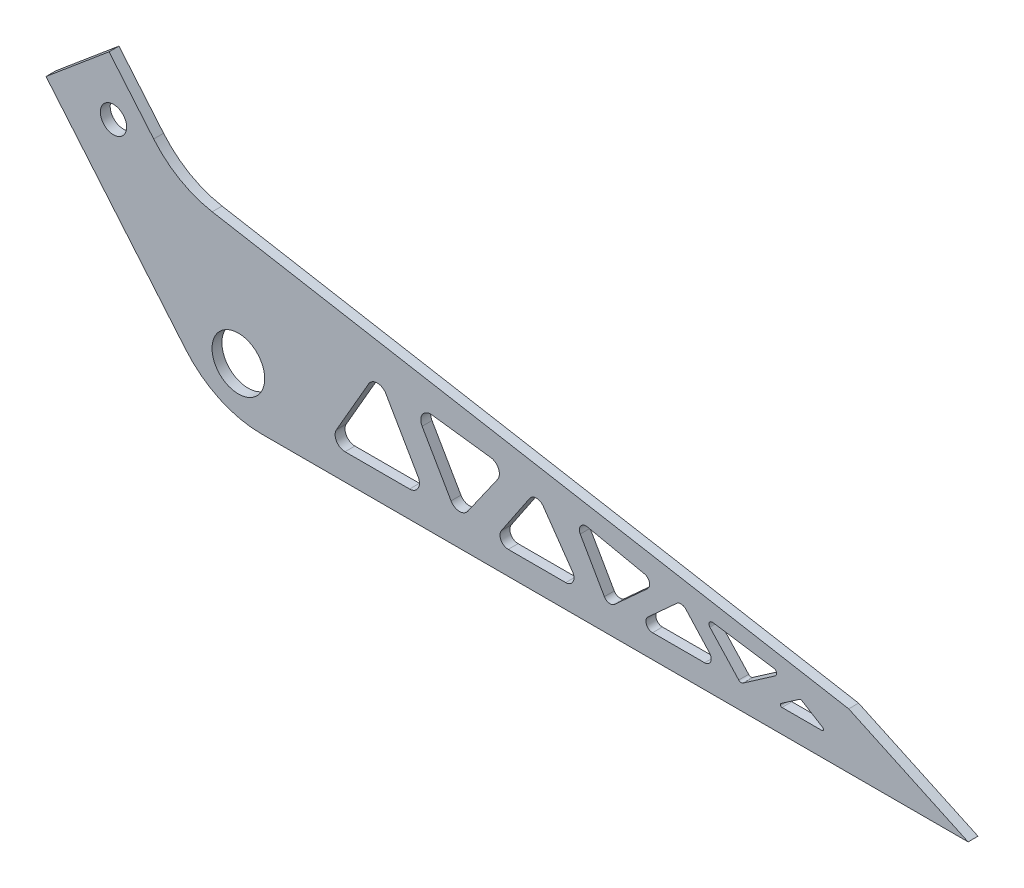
ISO-10303-21;
HEADER;
FILE_DESCRIPTION(('STEP AP214'),'2;1');
FILE_NAME('part.step','',(''),(''),'','','');
FILE_SCHEMA(('AUTOMOTIVE_DESIGN { 1 0 10303 214 1 1 1 1 }'));
ENDSEC;
DATA;
#1=APPLICATION_CONTEXT('core data for automotive mechanical design processes');
#2=APPLICATION_PROTOCOL_DEFINITION('international standard','automotive_design',2000,#1);
#3=PRODUCT_CONTEXT('',#1,'mechanical');
#4=PRODUCT('Part','Part','',(#3));
#5=PRODUCT_RELATED_PRODUCT_CATEGORY('part','',(#4));
#6=PRODUCT_DEFINITION_FORMATION('','',#4);
#7=PRODUCT_DEFINITION_CONTEXT('part definition',#1,'design');
#8=PRODUCT_DEFINITION('design','',#6,#7);
#9=PRODUCT_DEFINITION_SHAPE('','',#8);
#10=(LENGTH_UNIT() NAMED_UNIT(*) SI_UNIT(.MILLI.,.METRE.));
#11=(NAMED_UNIT(*) PLANE_ANGLE_UNIT() SI_UNIT($,.RADIAN.));
#12=(NAMED_UNIT(*) SI_UNIT($,.STERADIAN.) SOLID_ANGLE_UNIT());
#13=UNCERTAINTY_MEASURE_WITH_UNIT(LENGTH_MEASURE(1.E-05),#10,'distance_accuracy_value','');
#14=(GEOMETRIC_REPRESENTATION_CONTEXT(3) GLOBAL_UNCERTAINTY_ASSIGNED_CONTEXT((#13)) GLOBAL_UNIT_ASSIGNED_CONTEXT((#10,
#11,#12)) REPRESENTATION_CONTEXT('',''));
#15=CARTESIAN_POINT('',(0.,0.,0.));
#16=DIRECTION('',(0.,0.,1.));
#17=DIRECTION('',(1.,0.,0.));
#18=AXIS2_PLACEMENT_3D('',#15,#16,#17);
#19=CARTESIAN_POINT('',(86.9876313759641,80.2324715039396,3.));
#20=DIRECTION('',(-0.735072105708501,-0.677988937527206,0.));
#21=DIRECTION('',(0.677988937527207,-0.735072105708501,0.));
#22=AXIS2_PLACEMENT_3D('',#19,#20,#21);
#23=PLANE('',#22);
#24=DIRECTION('',(-0.677988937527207,0.735072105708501,0.));
#25=VECTOR('',#24,1.);
#26=CARTESIAN_POINT('',(86.9876313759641,80.2324715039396,0.));
#27=LINE('',#26,#25);
#28=CARTESIAN_POINT('',(210.371148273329,-53.5393005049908,0.));
#29=VERTEX_POINT('',#28);
#30=CARTESIAN_POINT('',(201.593510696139,-44.0226311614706,0.));
#31=VERTEX_POINT('',#30);
#32=EDGE_CURVE('E586',#29,#31,#27,.T.);
#33=ORIENTED_EDGE('',*,*,#32,.T.);
#34=DIRECTION('',(0.,0.,-1.));
#35=VECTOR('',#34,1.);
#36=CARTESIAN_POINT('',(201.593510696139,-44.0226311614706,3.));
#37=LINE('',#36,#35);
#38=CARTESIAN_POINT('',(201.593510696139,-44.0226311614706,3.));
#39=VERTEX_POINT('',#38);
#40=EDGE_CURVE('E11',#39,#31,#37,.T.);
#41=ORIENTED_EDGE('',*,*,#40,.F.);
#42=DIRECTION('',(-0.677988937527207,0.735072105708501,0.));
#43=VECTOR('',#42,1.);
#44=CARTESIAN_POINT('',(86.9876313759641,80.2324715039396,3.));
#45=LINE('',#44,#43);
#46=CARTESIAN_POINT('',(210.371148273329,-53.5393005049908,3.));
#47=VERTEX_POINT('',#46);
#48=EDGE_CURVE('E936',#47,#39,#45,.T.);
#49=ORIENTED_EDGE('',*,*,#48,.F.);
#50=DIRECTION('',(0.,0.,-1.));
#51=VECTOR('',#50,1.);
#52=CARTESIAN_POINT('',(210.371148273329,-53.5393005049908,3.));
#53=LINE('',#52,#51);
#54=EDGE_CURVE('E61',#47,#29,#53,.T.);
#55=ORIENTED_EDGE('',*,*,#54,.T.);
#56=EDGE_LOOP('',(#33,#41,#49,#55));
#57=FACE_BOUND('',#56,.T.);
#58=ADVANCED_FACE('F41',(#57),#23,.F.);
#59=CARTESIAN_POINT('',(202.328582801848,-43.3446422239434,3.));
#60=DIRECTION('',(0.,0.,-1.));
#61=DIRECTION('',(-1.,0.,0.));
#62=AXIS2_PLACEMENT_3D('',#59,#60,#61);
#63=CYLINDRICAL_SURFACE('',#62,1.00000000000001);
#64=CARTESIAN_POINT('',(202.328582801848,-43.3446422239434,0.));
#65=DIRECTION('',(0.,0.,1.));
#66=DIRECTION('',(1.,0.,0.));
#67=AXIS2_PLACEMENT_3D('',#64,#65,#66);
#68=CIRCLE('',#67,1.00000000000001);
#69=CARTESIAN_POINT('',(202.475506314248,-42.3554943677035,0.));
#70=VERTEX_POINT('',#69);
#71=EDGE_CURVE('E589',#31,#70,#68,.F.);
#72=ORIENTED_EDGE('',*,*,#71,.T.);
#73=DIRECTION('',(0.,0.,-1.));
#74=VECTOR('',#73,1.);
#75=CARTESIAN_POINT('',(202.475506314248,-42.3554943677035,3.));
#76=LINE('',#75,#74);
#77=CARTESIAN_POINT('',(202.475506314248,-42.3554943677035,3.));
#78=VERTEX_POINT('',#77);
#79=EDGE_CURVE('E52',#78,#70,#76,.T.);
#80=ORIENTED_EDGE('',*,*,#79,.F.);
#81=CARTESIAN_POINT('',(202.328582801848,-43.3446422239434,3.));
#82=DIRECTION('',(0.,0.,1.));
#83=DIRECTION('',(1.,0.,0.));
#84=AXIS2_PLACEMENT_3D('',#81,#82,#83);
#85=CIRCLE('',#84,1.00000000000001);
#86=EDGE_CURVE('E395',#39,#78,#85,.F.);
#87=ORIENTED_EDGE('',*,*,#86,.F.);
#88=ORIENTED_EDGE('',*,*,#40,.T.);
#89=EDGE_LOOP('',(#72,#80,#87,#88));
#90=FACE_BOUND('',#89,.T.);
#91=ADVANCED_FACE('F942',(#90),#63,.F.);
#92=CARTESIAN_POINT('',(-1.78474365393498,-12.0156081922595,3.));
#93=DIRECTION('',(0.146923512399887,0.989147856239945,0.));
#94=DIRECTION('',(-0.989147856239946,0.146923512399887,0.));
#95=AXIS2_PLACEMENT_3D('',#92,#93,#94);
#96=PLANE('',#95);
#97=DIRECTION('',(0.989147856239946,-0.146923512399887,0.));
#98=VECTOR('',#97,1.);
#99=CARTESIAN_POINT('',(-1.78474365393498,-12.0156081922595,0.));
#100=LINE('',#99,#98);
#101=CARTESIAN_POINT('',(221.013850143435,-45.1090954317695,0.));
#102=VERTEX_POINT('',#101);
#103=EDGE_CURVE('E592',#70,#102,#100,.T.);
#104=ORIENTED_EDGE('',*,*,#103,.T.);
#105=DIRECTION('',(0.,0.,-1.));
#106=VECTOR('',#105,1.);
#107=CARTESIAN_POINT('',(221.013850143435,-45.1090954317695,3.));
#108=LINE('',#107,#106);
#109=CARTESIAN_POINT('',(221.013850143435,-45.1090954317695,3.));
#110=VERTEX_POINT('',#109);
#111=EDGE_CURVE('E378',#110,#102,#108,.T.);
#112=ORIENTED_EDGE('',*,*,#111,.F.);
#113=DIRECTION('',(0.989147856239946,-0.146923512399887,0.));
#114=VECTOR('',#113,1.);
#115=CARTESIAN_POINT('',(-1.78474365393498,-12.0156081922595,3.));
#116=LINE('',#115,#114);
#117=EDGE_CURVE('E390',#78,#110,#116,.T.);
#118=ORIENTED_EDGE('',*,*,#117,.F.);
#119=ORIENTED_EDGE('',*,*,#79,.T.);
#120=EDGE_LOOP('',(#104,#112,#118,#119));
#121=FACE_BOUND('',#120,.T.);
#122=ADVANCED_FACE('F945',(#121),#96,.F.);
#123=CARTESIAN_POINT('',(220.866926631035,-46.0982432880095,3.));
#124=DIRECTION('',(0.,0.,-1.));
#125=DIRECTION('',(-1.,0.,0.));
#126=AXIS2_PLACEMENT_3D('',#123,#124,#125);
#127=CYLINDRICAL_SURFACE('',#126,0.999999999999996);
#128=CARTESIAN_POINT('',(220.866926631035,-46.0982432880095,0.));
#129=DIRECTION('',(0.,0.,1.));
#130=DIRECTION('',(1.,0.,0.));
#131=AXIS2_PLACEMENT_3D('',#128,#129,#130);
#132=CIRCLE('',#131,0.999999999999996);
#133=CARTESIAN_POINT('',(221.436458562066,-46.9202124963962,0.));
#134=VERTEX_POINT('',#133);
#135=EDGE_CURVE('E374',#134,#102,#132,.T.);
#136=ORIENTED_EDGE('',*,*,#135,.F.);
#137=DIRECTION('',(0.,0.,-1.));
#138=VECTOR('',#137,1.);
#139=CARTESIAN_POINT('',(221.436458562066,-46.9202124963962,3.));
#140=LINE('',#139,#138);
#141=CARTESIAN_POINT('',(221.436458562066,-46.9202124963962,3.));
#142=VERTEX_POINT('',#141);
#143=EDGE_CURVE('E368',#142,#134,#140,.T.);
#144=ORIENTED_EDGE('',*,*,#143,.F.);
#145=CARTESIAN_POINT('',(220.866926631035,-46.0982432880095,3.));
#146=DIRECTION('',(0.,0.,1.));
#147=DIRECTION('',(1.,0.,0.));
#148=AXIS2_PLACEMENT_3D('',#145,#146,#147);
#149=CIRCLE('',#148,0.999999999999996);
#150=EDGE_CURVE('E372',#142,#110,#149,.T.);
#151=ORIENTED_EDGE('',*,*,#150,.T.);
#152=ORIENTED_EDGE('',*,*,#111,.T.);
#153=EDGE_LOOP('',(#136,#144,#151,#152));
#154=FACE_BOUND('',#153,.T.);
#155=ADVANCED_FACE('F370',(#154),#127,.F.);
#156=CARTESIAN_POINT('',(93.7917165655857,-135.363618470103,3.));
#157=DIRECTION('',(0.569531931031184,-0.821969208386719,0.));
#158=DIRECTION('',(0.82196920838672,0.569531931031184,0.));
#159=AXIS2_PLACEMENT_3D('',#156,#157,#158);
#160=PLANE('',#159);
#161=DIRECTION('',(-0.821969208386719,-0.569531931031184,0.));
#162=VECTOR('',#161,1.);
#163=CARTESIAN_POINT('',(93.7917165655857,-135.363618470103,0.));
#164=LINE('',#163,#162);
#165=CARTESIAN_POINT('',(211.675752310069,-53.6832807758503,0.));
#166=VERTEX_POINT('',#165);
#167=EDGE_CURVE('E598',#134,#166,#164,.T.);
#168=ORIENTED_EDGE('',*,*,#167,.T.);
#169=DIRECTION('',(0.,0.,-1.));
#170=VECTOR('',#169,1.);
#171=CARTESIAN_POINT('',(211.675752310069,-53.6832807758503,3.));
#172=LINE('',#171,#170);
#173=CARTESIAN_POINT('',(211.675752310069,-53.6832807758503,3.));
#174=VERTEX_POINT('',#173);
#175=EDGE_CURVE('E214',#174,#166,#172,.T.);
#176=ORIENTED_EDGE('',*,*,#175,.F.);
#177=DIRECTION('',(-0.821969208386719,-0.569531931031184,0.));
#178=VECTOR('',#177,1.);
#179=CARTESIAN_POINT('',(93.7917165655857,-135.363618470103,3.));
#180=LINE('',#179,#178);
#181=EDGE_CURVE('E380',#142,#174,#180,.T.);
#182=ORIENTED_EDGE('',*,*,#181,.F.);
#183=ORIENTED_EDGE('',*,*,#143,.T.);
#184=EDGE_LOOP('',(#168,#176,#182,#183));
#185=FACE_BOUND('',#184,.T.);
#186=ADVANCED_FACE('F381',(#185),#160,.F.);
#187=CARTESIAN_POINT('',(105.24298254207,60.2801388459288,3.));
#188=DIRECTION('',(0.867740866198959,0.497016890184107,0.));
#189=DIRECTION('',(-0.497016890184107,0.867740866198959,0.));
#190=AXIS2_PLACEMENT_3D('',#187,#188,#189);
#191=PLANE('',#190);
#192=DIRECTION('',(0.497016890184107,-0.867740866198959,0.));
#193=VECTOR('',#192,1.);
#194=CARTESIAN_POINT('',(105.24298254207,60.2801388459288,0.));
#195=LINE('',#194,#193);
#196=CARTESIAN_POINT('',(162.227076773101,-39.2082855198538,0.));
#197=VERTEX_POINT('',#196);
#198=CARTESIAN_POINT('',(169.563014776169,-52.0160860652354,0.));
#199=VERTEX_POINT('',#198);
#200=EDGE_CURVE('E562',#197,#199,#195,.T.);
#201=ORIENTED_EDGE('',*,*,#200,.F.);
#202=DIRECTION('',(0.,0.,-1.));
#203=VECTOR('',#202,1.);
#204=CARTESIAN_POINT('',(162.227076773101,-39.2082855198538,3.));
#205=LINE('',#204,#203);
#206=CARTESIAN_POINT('',(162.227076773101,-39.2082855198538,3.));
#207=VERTEX_POINT('',#206);
#208=EDGE_CURVE('E608',#207,#197,#205,.T.);
#209=ORIENTED_EDGE('',*,*,#208,.F.);
#210=DIRECTION('',(0.497016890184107,-0.867740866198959,0.));
#211=VECTOR('',#210,1.);
#212=CARTESIAN_POINT('',(105.24298254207,60.2801388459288,3.));
#213=LINE('',#212,#211);
#214=CARTESIAN_POINT('',(169.563014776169,-52.0160860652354,3.));
#215=VERTEX_POINT('',#214);
#216=EDGE_CURVE('E914',#207,#215,#213,.T.);
#217=ORIENTED_EDGE('',*,*,#216,.T.);
#218=DIRECTION('',(0.,0.,-1.));
#219=VECTOR('',#218,1.);
#220=CARTESIAN_POINT('',(169.563014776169,-52.0160860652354,3.));
#221=LINE('',#220,#219);
#222=EDGE_CURVE('E616',#215,#199,#221,.T.);
#223=ORIENTED_EDGE('',*,*,#222,.T.);
#224=EDGE_LOOP('',(#201,#209,#217,#223));
#225=FACE_BOUND('',#224,.T.);
#226=ADVANCED_FACE('F988',(#225),#191,.T.);
#227=CARTESIAN_POINT('',(163.962558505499,-38.2142517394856,3.));
#228=DIRECTION('',(0.,0.,-1.));
#229=DIRECTION('',(-1.,0.,0.));
#230=AXIS2_PLACEMENT_3D('',#227,#228,#229);
#231=CYLINDRICAL_SURFACE('',#230,1.99999999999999);
#232=CARTESIAN_POINT('',(163.962558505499,-38.2142517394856,0.));
#233=DIRECTION('',(0.,0.,1.));
#234=DIRECTION('',(1.,0.,0.));
#235=AXIS2_PLACEMENT_3D('',#232,#233,#234);
#236=CIRCLE('',#235,1.99999999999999);
#237=CARTESIAN_POINT('',(164.377084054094,-36.2576811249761,0.));
#238=VERTEX_POINT('',#237);
#239=EDGE_CURVE('E566',#197,#238,#236,.F.);
#240=ORIENTED_EDGE('',*,*,#239,.T.);
#241=DIRECTION('',(0.,0.,-1.));
#242=VECTOR('',#241,1.);
#243=CARTESIAN_POINT('',(164.377084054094,-36.2576811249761,3.));
#244=LINE('',#243,#242);
#245=CARTESIAN_POINT('',(164.377084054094,-36.2576811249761,3.));
#246=VERTEX_POINT('',#245);
#247=EDGE_CURVE('E629',#246,#238,#244,.T.);
#248=ORIENTED_EDGE('',*,*,#247,.F.);
#249=CARTESIAN_POINT('',(163.962558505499,-38.2142517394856,3.));
#250=DIRECTION('',(0.,0.,1.));
#251=DIRECTION('',(1.,0.,0.));
#252=AXIS2_PLACEMENT_3D('',#249,#250,#251);
#253=CIRCLE('',#252,1.99999999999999);
#254=EDGE_CURVE('E918',#207,#246,#253,.F.);
#255=ORIENTED_EDGE('',*,*,#254,.F.);
#256=ORIENTED_EDGE('',*,*,#208,.T.);
#257=EDGE_LOOP('',(#240,#248,#255,#256));
#258=FACE_BOUND('',#257,.T.);
#259=ADVANCED_FACE('F984',(#258),#231,.F.);
#260=CARTESIAN_POINT('',(-0.29039716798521,-1.37068165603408,3.));
#261=DIRECTION('',(-0.207262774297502,-0.978285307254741,0.));
#262=DIRECTION('',(0.978285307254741,-0.207262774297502,0.));
#263=AXIS2_PLACEMENT_3D('',#260,#261,#262);
#264=PLANE('',#263);
#265=DIRECTION('',(-0.978285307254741,0.207262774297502,0.));
#266=VECTOR('',#265,1.);
#267=CARTESIAN_POINT('',(-0.29039716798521,-1.37068165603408,0.));
#268=LINE('',#267,#266);
#269=CARTESIAN_POINT('',(181.742624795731,-39.9368022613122,0.));
#270=VERTEX_POINT('',#269);
#271=EDGE_CURVE('E570',#270,#238,#268,.T.);
#272=ORIENTED_EDGE('',*,*,#271,.F.);
#273=DIRECTION('',(0.,0.,-1.));
#274=VECTOR('',#273,1.);
#275=CARTESIAN_POINT('',(181.742624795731,-39.9368022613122,3.));
#276=LINE('',#275,#274);
#277=CARTESIAN_POINT('',(181.742624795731,-39.9368022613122,3.));
#278=VERTEX_POINT('',#277);
#279=EDGE_CURVE('E626',#278,#270,#276,.T.);
#280=ORIENTED_EDGE('',*,*,#279,.F.);
#281=DIRECTION('',(-0.978285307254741,0.207262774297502,0.));
#282=VECTOR('',#281,1.);
#283=CARTESIAN_POINT('',(-0.29039716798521,-1.37068165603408,3.));
#284=LINE('',#283,#282);
#285=EDGE_CURVE('E921',#278,#246,#284,.T.);
#286=ORIENTED_EDGE('',*,*,#285,.T.);
#287=ORIENTED_EDGE('',*,*,#247,.T.);
#288=EDGE_LOOP('',(#272,#280,#286,#287));
#289=FACE_BOUND('',#288,.T.);
#290=ADVANCED_FACE('F980',(#289),#264,.T.);
#291=CARTESIAN_POINT('',(181.328099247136,-41.8933728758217,3.));
#292=DIRECTION('',(0.,0.,-1.));
#293=DIRECTION('',(-1.,0.,0.));
#294=AXIS2_PLACEMENT_3D('',#291,#292,#293);
#295=CYLINDRICAL_SURFACE('',#294,2.);
#296=CARTESIAN_POINT('',(181.328099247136,-41.8933728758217,0.));
#297=DIRECTION('',(0.,0.,1.));
#298=DIRECTION('',(1.,0.,0.));
#299=AXIS2_PLACEMENT_3D('',#296,#297,#298);
#300=CIRCLE('',#299,2.);
#301=CARTESIAN_POINT('',(182.674321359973,-43.3724557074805,0.));
#302=VERTEX_POINT('',#301);
#303=EDGE_CURVE('E574',#302,#270,#300,.T.);
#304=ORIENTED_EDGE('',*,*,#303,.F.);
#305=DIRECTION('',(0.,0.,-1.));
#306=VECTOR('',#305,1.);
#307=CARTESIAN_POINT('',(182.674321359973,-43.3724557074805,3.));
#308=LINE('',#307,#306);
#309=CARTESIAN_POINT('',(182.674321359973,-43.3724557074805,3.));
#310=VERTEX_POINT('',#309);
#311=EDGE_CURVE('E623',#310,#302,#308,.T.);
#312=ORIENTED_EDGE('',*,*,#311,.F.);
#313=CARTESIAN_POINT('',(181.328099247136,-41.8933728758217,3.));
#314=DIRECTION('',(0.,0.,1.));
#315=DIRECTION('',(1.,0.,0.));
#316=AXIS2_PLACEMENT_3D('',#313,#314,#315);
#317=CIRCLE('',#316,2.);
#318=EDGE_CURVE('E925',#310,#278,#317,.T.);
#319=ORIENTED_EDGE('',*,*,#318,.T.);
#320=ORIENTED_EDGE('',*,*,#279,.T.);
#321=EDGE_LOOP('',(#304,#312,#319,#320));
#322=FACE_BOUND('',#321,.T.);
#323=ADVANCED_FACE('F976',(#322),#295,.F.);
#324=CARTESIAN_POINT('',(104.356333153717,-114.655419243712,3.));
#325=DIRECTION('',(-0.673111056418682,0.739541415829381,0.));
#326=DIRECTION('',(-0.739541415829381,-0.673111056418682,0.));
#327=AXIS2_PLACEMENT_3D('',#324,#325,#326);
#328=PLANE('',#327);
#329=DIRECTION('',(0.739541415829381,0.673111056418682,0.));
#330=VECTOR('',#329,1.);
#331=CARTESIAN_POINT('',(104.356333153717,-114.655419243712,0.));
#332=LINE('',#331,#330);
#333=CARTESIAN_POINT('',(172.644718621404,-52.501135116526,0.));
#334=VERTEX_POINT('',#333);
#335=EDGE_CURVE('E578',#334,#302,#332,.T.);
#336=ORIENTED_EDGE('',*,*,#335,.F.);
#337=DIRECTION('',(0.,0.,-1.));
#338=VECTOR('',#337,1.);
#339=CARTESIAN_POINT('',(172.644718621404,-52.501135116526,3.));
#340=LINE('',#339,#338);
#341=CARTESIAN_POINT('',(172.644718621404,-52.501135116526,3.));
#342=VERTEX_POINT('',#341);
#343=EDGE_CURVE('E619',#342,#334,#340,.T.);
#344=ORIENTED_EDGE('',*,*,#343,.F.);
#345=DIRECTION('',(0.739541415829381,0.673111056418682,0.));
#346=VECTOR('',#345,1.);
#347=CARTESIAN_POINT('',(104.356333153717,-114.655419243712,3.));
#348=LINE('',#347,#346);
#349=EDGE_CURVE('E929',#342,#310,#348,.T.);
#350=ORIENTED_EDGE('',*,*,#349,.T.);
#351=ORIENTED_EDGE('',*,*,#311,.T.);
#352=EDGE_LOOP('',(#336,#344,#350,#351));
#353=FACE_BOUND('',#352,.T.);
#354=ADVANCED_FACE('F972',(#353),#328,.T.);
#355=CARTESIAN_POINT('',(118.507028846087,-79.6973943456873,3.));
#356=DIRECTION('',(0.829804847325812,-0.558053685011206,0.));
#357=DIRECTION('',(0.558053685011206,0.829804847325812,0.));
#358=AXIS2_PLACEMENT_3D('',#355,#356,#357);
#359=PLANE('',#358);
#360=DIRECTION('',(-0.558053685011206,-0.829804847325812,0.));
#361=VECTOR('',#360,1.);
#362=CARTESIAN_POINT('',(118.507028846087,-79.6973943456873,0.));
#363=LINE('',#362,#361);
#364=CARTESIAN_POINT('',(146.866209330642,-37.5283592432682,0.));
#365=VERTEX_POINT('',#364);
#366=CARTESIAN_POINT('',(138.288222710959,-50.2835028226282,0.));
#367=VERTEX_POINT('',#366);
#368=EDGE_CURVE('E538',#365,#367,#363,.T.);
#369=ORIENTED_EDGE('',*,*,#368,.F.);
#370=DIRECTION('',(0.,0.,-1.));
#371=VECTOR('',#370,1.);
#372=CARTESIAN_POINT('',(146.866209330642,-37.5283592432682,3.));
#373=LINE('',#372,#371);
#374=CARTESIAN_POINT('',(146.866209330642,-37.5283592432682,3.));
#375=VERTEX_POINT('',#374);
#376=EDGE_CURVE('E620',#375,#365,#373,.T.);
#377=ORIENTED_EDGE('',*,*,#376,.F.);
#378=DIRECTION('',(-0.558053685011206,-0.829804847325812,0.));
#379=VECTOR('',#378,1.);
#380=CARTESIAN_POINT('',(118.507028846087,-79.6973943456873,3.));
#381=LINE('',#380,#379);
#382=CARTESIAN_POINT('',(138.288222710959,-50.2835028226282,3.));
#383=VERTEX_POINT('',#382);
#384=EDGE_CURVE('E891',#375,#383,#381,.T.);
#385=ORIENTED_EDGE('',*,*,#384,.T.);
#386=DIRECTION('',(0.,0.,-1.));
#387=VECTOR('',#386,1.);
#388=CARTESIAN_POINT('',(138.288222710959,-50.2835028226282,3.));
#389=LINE('',#388,#387);
#390=EDGE_CURVE('E634',#383,#367,#389,.T.);
#391=ORIENTED_EDGE('',*,*,#390,.T.);
#392=EDGE_LOOP('',(#369,#377,#385,#391));
#393=FACE_BOUND('',#392,.T.);
#394=ADVANCED_FACE('F975',(#393),#359,.T.);
#395=CARTESIAN_POINT('',(148.940721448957,-38.9234934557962,3.));
#396=DIRECTION('',(0.,0.,-1.));
#397=DIRECTION('',(-1.,0.,0.));
#398=AXIS2_PLACEMENT_3D('',#395,#396,#397);
#399=CYLINDRICAL_SURFACE('',#398,2.50000000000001);
#400=CARTESIAN_POINT('',(148.940721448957,-38.9234934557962,0.));
#401=DIRECTION('',(0.,0.,1.));
#402=DIRECTION('',(1.,0.,0.));
#403=AXIS2_PLACEMENT_3D('',#400,#401,#402);
#404=CIRCLE('',#403,2.50000000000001);
#405=CARTESIAN_POINT('',(150.992093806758,-37.4945527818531,0.));
#406=VERTEX_POINT('',#405);
#407=EDGE_CURVE('E542',#365,#406,#404,.F.);
#408=ORIENTED_EDGE('',*,*,#407,.T.);
#409=DIRECTION('',(0.,0.,-1.));
#410=VECTOR('',#409,1.);
#411=CARTESIAN_POINT('',(150.992093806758,-37.4945527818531,3.));
#412=LINE('',#411,#410);
#413=CARTESIAN_POINT('',(150.992093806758,-37.4945527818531,3.));
#414=VERTEX_POINT('',#413);
#415=EDGE_CURVE('E647',#414,#406,#412,.T.);
#416=ORIENTED_EDGE('',*,*,#415,.F.);
#417=CARTESIAN_POINT('',(148.940721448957,-38.9234934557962,3.));
#418=DIRECTION('',(0.,0.,1.));
#419=DIRECTION('',(1.,0.,0.));
#420=AXIS2_PLACEMENT_3D('',#417,#418,#419);
#421=CIRCLE('',#420,2.50000000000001);
#422=EDGE_CURVE('E895',#375,#414,#421,.F.);
#423=ORIENTED_EDGE('',*,*,#422,.F.);
#424=ORIENTED_EDGE('',*,*,#376,.T.);
#425=EDGE_LOOP('',(#408,#416,#423,#424));
#426=FACE_BOUND('',#425,.T.);
#427=ADVANCED_FACE('F1009',(#426),#399,.F.);
#428=CARTESIAN_POINT('',(84.0778809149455,58.5667947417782,3.));
#429=DIRECTION('',(-0.820548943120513,-0.571576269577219,0.));
#430=DIRECTION('',(0.571576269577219,-0.820548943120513,0.));
#431=AXIS2_PLACEMENT_3D('',#428,#429,#430);
#432=PLANE('',#431);
#433=DIRECTION('',(-0.571576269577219,0.820548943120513,0.));
#434=VECTOR('',#433,1.);
#435=CARTESIAN_POINT('',(84.0778809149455,58.5667947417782,0.));
#436=LINE('',#435,#434);
#437=CARTESIAN_POINT('',(159.877045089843,-50.2496963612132,0.));
#438=VERTEX_POINT('',#437);
#439=EDGE_CURVE('E546',#438,#406,#436,.T.);
#440=ORIENTED_EDGE('',*,*,#439,.F.);
#441=DIRECTION('',(0.,0.,-1.));
#442=VECTOR('',#441,1.);
#443=CARTESIAN_POINT('',(159.877045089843,-50.2496963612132,3.));
#444=LINE('',#443,#442);
#445=CARTESIAN_POINT('',(159.877045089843,-50.2496963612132,3.));
#446=VERTEX_POINT('',#445);
#447=EDGE_CURVE('E644',#446,#438,#444,.T.);
#448=ORIENTED_EDGE('',*,*,#447,.F.);
#449=DIRECTION('',(-0.571576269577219,0.820548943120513,0.));
#450=VECTOR('',#449,1.);
#451=CARTESIAN_POINT('',(84.0778809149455,58.5667947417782,3.));
#452=LINE('',#451,#450);
#453=EDGE_CURVE('E898',#446,#414,#452,.T.);
#454=ORIENTED_EDGE('',*,*,#453,.T.);
#455=ORIENTED_EDGE('',*,*,#415,.T.);
#456=EDGE_LOOP('',(#440,#448,#454,#455));
#457=FACE_BOUND('',#456,.T.);
#458=ADVANCED_FACE('F1005',(#457),#432,.T.);
#459=CARTESIAN_POINT('',(157.825672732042,-51.6786370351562,3.));
#460=DIRECTION('',(0.,0.,-1.));
#461=DIRECTION('',(-1.,0.,0.));
#462=AXIS2_PLACEMENT_3D('',#459,#460,#461);
#463=CYLINDRICAL_SURFACE('',#462,2.5);
#464=CARTESIAN_POINT('',(157.825672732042,-51.6786370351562,0.));
#465=DIRECTION('',(0.,0.,1.));
#466=DIRECTION('',(1.,0.,0.));
#467=AXIS2_PLACEMENT_3D('',#464,#465,#466);
#468=CIRCLE('',#467,2.5);
#469=CARTESIAN_POINT('',(157.825672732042,-54.1786370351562,0.));
#470=VERTEX_POINT('',#469);
#471=EDGE_CURVE('E550',#470,#438,#468,.T.);
#472=ORIENTED_EDGE('',*,*,#471,.F.);
#473=DIRECTION('',(0.,0.,-1.));
#474=VECTOR('',#473,1.);
#475=CARTESIAN_POINT('',(157.825672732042,-54.1786370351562,3.));
#476=LINE('',#475,#474);
#477=CARTESIAN_POINT('',(157.825672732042,-54.1786370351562,3.));
#478=VERTEX_POINT('',#477);
#479=EDGE_CURVE('E641',#478,#470,#476,.T.);
#480=ORIENTED_EDGE('',*,*,#479,.F.);
#481=CARTESIAN_POINT('',(157.825672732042,-51.6786370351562,3.));
#482=DIRECTION('',(0.,0.,1.));
#483=DIRECTION('',(1.,0.,0.));
#484=AXIS2_PLACEMENT_3D('',#481,#482,#483);
#485=CIRCLE('',#484,2.5);
#486=EDGE_CURVE('E902',#478,#446,#485,.T.);
#487=ORIENTED_EDGE('',*,*,#486,.T.);
#488=ORIENTED_EDGE('',*,*,#447,.T.);
#489=EDGE_LOOP('',(#472,#480,#487,#488));
#490=FACE_BOUND('',#489,.T.);
#491=ADVANCED_FACE('F1001',(#490),#463,.F.);
#492=CARTESIAN_POINT('',(0.,-54.1786370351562,3.));
#493=DIRECTION('',(0.,1.,0.));
#494=DIRECTION('',(0.,0.,1.));
#495=AXIS2_PLACEMENT_3D('',#492,#493,#494);
#496=PLANE('',#495);
#497=DIRECTION('',(1.,0.,0.));
#498=VECTOR('',#497,1.);
#499=CARTESIAN_POINT('',(0.,-54.1786370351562,0.));
#500=LINE('',#499,#498);
#501=CARTESIAN_POINT('',(140.362734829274,-54.1786370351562,0.));
#502=VERTEX_POINT('',#501);
#503=EDGE_CURVE('E554',#502,#470,#500,.T.);
#504=ORIENTED_EDGE('',*,*,#503,.F.);
#505=DIRECTION('',(0.,0.,-1.));
#506=VECTOR('',#505,1.);
#507=CARTESIAN_POINT('',(140.362734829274,-54.1786370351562,3.));
#508=LINE('',#507,#506);
#509=CARTESIAN_POINT('',(140.362734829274,-54.1786370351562,3.));
#510=VERTEX_POINT('',#509);
#511=EDGE_CURVE('E637',#510,#502,#508,.T.);
#512=ORIENTED_EDGE('',*,*,#511,.F.);
#513=DIRECTION('',(1.,0.,0.));
#514=VECTOR('',#513,1.);
#515=CARTESIAN_POINT('',(0.,-54.1786370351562,3.));
#516=LINE('',#515,#514);
#517=EDGE_CURVE('E906',#510,#478,#516,.T.);
#518=ORIENTED_EDGE('',*,*,#517,.T.);
#519=ORIENTED_EDGE('',*,*,#479,.T.);
#520=EDGE_LOOP('',(#504,#512,#518,#519));
#521=FACE_BOUND('',#520,.T.);
#522=ADVANCED_FACE('F997',(#521),#496,.T.);
#523=CARTESIAN_POINT('',(70.5596489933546,40.7376323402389,3.));
#524=DIRECTION('',(0.866025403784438,0.500000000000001,0.));
#525=DIRECTION('',(-0.500000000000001,0.866025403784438,0.));
#526=AXIS2_PLACEMENT_3D('',#523,#524,#525);
#527=PLANE('',#526);
#528=DIRECTION('',(0.500000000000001,-0.866025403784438,0.));
#529=VECTOR('',#528,1.);
#530=CARTESIAN_POINT('',(70.5596489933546,40.7376323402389,0.));
#531=LINE('',#530,#529);
#532=CARTESIAN_POINT('',(114.216704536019,-34.8786059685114,0.));
#533=VERTEX_POINT('',#532);
#534=CARTESIAN_POINT('',(123.006760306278,-50.1034291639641,0.));
#535=VERTEX_POINT('',#534);
#536=EDGE_CURVE('E514',#533,#535,#531,.T.);
#537=ORIENTED_EDGE('',*,*,#536,.F.);
#538=DIRECTION('',(0.,0.,-1.));
#539=VECTOR('',#538,1.);
#540=CARTESIAN_POINT('',(114.216704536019,-34.8786059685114,3.));
#541=LINE('',#540,#539);
#542=CARTESIAN_POINT('',(114.216704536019,-34.8786059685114,3.));
#543=VERTEX_POINT('',#542);
#544=EDGE_CURVE('E638',#543,#533,#541,.T.);
#545=ORIENTED_EDGE('',*,*,#544,.F.);
#546=DIRECTION('',(0.500000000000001,-0.866025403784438,0.));
#547=VECTOR('',#546,1.);
#548=CARTESIAN_POINT('',(70.5596489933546,40.7376323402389,3.));
#549=LINE('',#548,#547);
#550=CARTESIAN_POINT('',(123.006760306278,-50.1034291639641,3.));
#551=VERTEX_POINT('',#550);
#552=EDGE_CURVE('E868',#543,#551,#549,.T.);
#553=ORIENTED_EDGE('',*,*,#552,.T.);
#554=DIRECTION('',(0.,0.,-1.));
#555=VECTOR('',#554,1.);
#556=CARTESIAN_POINT('',(123.006760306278,-50.1034291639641,3.));
#557=LINE('',#556,#555);
#558=EDGE_CURVE('E652',#551,#535,#557,.T.);
#559=ORIENTED_EDGE('',*,*,#558,.T.);
#560=EDGE_LOOP('',(#537,#545,#553,#559));
#561=FACE_BOUND('',#560,.T.);
#562=ADVANCED_FACE('F1000',(#561),#527,.T.);
#563=CARTESIAN_POINT('',(116.814780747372,-33.3786059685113,3.));
#564=DIRECTION('',(0.,0.,-1.));
#565=DIRECTION('',(-1.,0.,0.));
#566=AXIS2_PLACEMENT_3D('',#563,#564,#565);
#567=CYLINDRICAL_SURFACE('',#566,3.00000000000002);
#568=CARTESIAN_POINT('',(116.814780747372,-33.3786059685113,0.));
#569=DIRECTION('',(0.,0.,1.));
#570=DIRECTION('',(1.,0.,0.));
#571=AXIS2_PLACEMENT_3D('',#568,#569,#570);
#572=CIRCLE('',#571,3.00000000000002);
#573=CARTESIAN_POINT('',(117.193245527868,-30.4025743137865,0.));
#574=VERTEX_POINT('',#573);
#575=EDGE_CURVE('E518',#533,#574,#572,.F.);
#576=ORIENTED_EDGE('',*,*,#575,.T.);
#577=DIRECTION('',(0.,0.,-1.));
#578=VECTOR('',#577,1.);
#579=CARTESIAN_POINT('',(117.193245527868,-30.4025743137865,3.));
#580=LINE('',#579,#578);
#581=CARTESIAN_POINT('',(117.193245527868,-30.4025743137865,3.));
#582=VERTEX_POINT('',#581);
#583=EDGE_CURVE('E665',#582,#574,#580,.T.);
#584=ORIENTED_EDGE('',*,*,#583,.F.);
#585=CARTESIAN_POINT('',(116.814780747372,-33.3786059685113,3.));
#586=DIRECTION('',(0.,0.,1.));
#587=DIRECTION('',(1.,0.,0.));
#588=AXIS2_PLACEMENT_3D('',#585,#586,#587);
#589=CIRCLE('',#588,3.00000000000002);
#590=EDGE_CURVE('E872',#543,#582,#589,.F.);
#591=ORIENTED_EDGE('',*,*,#590,.F.);
#592=ORIENTED_EDGE('',*,*,#544,.T.);
#593=EDGE_LOOP('',(#576,#584,#591,#592));
#594=FACE_BOUND('',#593,.T.);
#595=ADVANCED_FACE('F1033',(#594),#567,.F.);
#596=CARTESIAN_POINT('',(-1.93965334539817,-15.2523300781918,3.));
#597=DIRECTION('',(-0.126154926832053,-0.992010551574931,0.));
#598=DIRECTION('',(0.992010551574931,-0.126154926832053,0.));
#599=AXIS2_PLACEMENT_3D('',#596,#597,#598);
#600=PLANE('',#599);
#601=DIRECTION('',(-0.992010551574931,0.126154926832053,0.));
#602=VECTOR('',#601,1.);
#603=CARTESIAN_POINT('',(-1.93965334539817,-15.2523300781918,0.));
#604=LINE('',#603,#602);
#605=CARTESIAN_POINT('',(135.065106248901,-32.6753558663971,0.));
#606=VERTEX_POINT('',#605);
#607=EDGE_CURVE('E522',#606,#574,#604,.T.);
#608=ORIENTED_EDGE('',*,*,#607,.F.);
#609=DIRECTION('',(0.,0.,-1.));
#610=VECTOR('',#609,1.);
#611=CARTESIAN_POINT('',(135.065106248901,-32.6753558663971,3.));
#612=LINE('',#611,#610);
#613=CARTESIAN_POINT('',(135.065106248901,-32.6753558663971,3.));
#614=VERTEX_POINT('',#613);
#615=EDGE_CURVE('E662',#614,#606,#612,.T.);
#616=ORIENTED_EDGE('',*,*,#615,.F.);
#617=DIRECTION('',(-0.992010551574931,0.126154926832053,0.));
#618=VECTOR('',#617,1.);
#619=CARTESIAN_POINT('',(-1.93965334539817,-15.2523300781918,3.));
#620=LINE('',#619,#618);
#621=EDGE_CURVE('E875',#614,#582,#620,.T.);
#622=ORIENTED_EDGE('',*,*,#621,.T.);
#623=ORIENTED_EDGE('',*,*,#583,.T.);
#624=EDGE_LOOP('',(#608,#616,#622,#623));
#625=FACE_BOUND('',#624,.T.);
#626=ADVANCED_FACE('F1029',(#625),#600,.T.);
#627=CARTESIAN_POINT('',(134.686641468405,-35.6513875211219,3.));
#628=DIRECTION('',(0.,0.,-1.));
#629=DIRECTION('',(-1.,0.,0.));
#630=AXIS2_PLACEMENT_3D('',#627,#628,#629);
#631=CYLINDRICAL_SURFACE('',#630,2.99999999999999);
#632=CARTESIAN_POINT('',(134.686641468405,-35.6513875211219,0.));
#633=DIRECTION('',(0.,0.,1.));
#634=DIRECTION('',(1.,0.,0.));
#635=AXIS2_PLACEMENT_3D('',#632,#633,#634);
#636=CIRCLE('',#635,2.99999999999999);
#637=CARTESIAN_POINT('',(137.142966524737,-37.3737310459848,0.));
#638=VERTEX_POINT('',#637);
#639=EDGE_CURVE('E526',#638,#606,#636,.T.);
#640=ORIENTED_EDGE('',*,*,#639,.F.);
#641=DIRECTION('',(0.,0.,-1.));
#642=VECTOR('',#641,1.);
#643=CARTESIAN_POINT('',(137.142966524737,-37.3737310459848,3.));
#644=LINE('',#643,#642);
#645=CARTESIAN_POINT('',(137.142966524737,-37.3737310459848,3.));
#646=VERTEX_POINT('',#645);
#647=EDGE_CURVE('E659',#646,#638,#644,.T.);
#648=ORIENTED_EDGE('',*,*,#647,.F.);
#649=CARTESIAN_POINT('',(134.686641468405,-35.6513875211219,3.));
#650=DIRECTION('',(0.,0.,1.));
#651=DIRECTION('',(1.,0.,0.));
#652=AXIS2_PLACEMENT_3D('',#649,#650,#651);
#653=CIRCLE('',#652,2.99999999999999);
#654=EDGE_CURVE('E879',#646,#614,#653,.T.);
#655=ORIENTED_EDGE('',*,*,#654,.T.);
#656=ORIENTED_EDGE('',*,*,#615,.T.);
#657=EDGE_LOOP('',(#640,#648,#655,#656));
#658=FACE_BOUND('',#657,.T.);
#659=ADVANCED_FACE('F1025',(#658),#631,.F.);
#660=CARTESIAN_POINT('',(109.507913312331,-76.785539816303,3.));
#661=DIRECTION('',(-0.81877501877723,0.574114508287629,0.));
#662=DIRECTION('',(-0.574114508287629,-0.81877501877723,0.));
#663=AXIS2_PLACEMENT_3D('',#660,#661,#662);
#664=PLANE('',#663);
#665=DIRECTION('',(0.574114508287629,0.81877501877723,0.));
#666=VECTOR('',#665,1.);
#667=CARTESIAN_POINT('',(109.507913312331,-76.785539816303,0.));
#668=LINE('',#667,#666);
#669=CARTESIAN_POINT('',(128.061161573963,-50.3257726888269,0.));
#670=VERTEX_POINT('',#669);
#671=EDGE_CURVE('E530',#670,#638,#668,.T.);
#672=ORIENTED_EDGE('',*,*,#671,.F.);
#673=DIRECTION('',(0.,0.,-1.));
#674=VECTOR('',#673,1.);
#675=CARTESIAN_POINT('',(128.061161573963,-50.3257726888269,3.));
#676=LINE('',#675,#674);
#677=CARTESIAN_POINT('',(128.061161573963,-50.3257726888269,3.));
#678=VERTEX_POINT('',#677);
#679=EDGE_CURVE('E655',#678,#670,#676,.T.);
#680=ORIENTED_EDGE('',*,*,#679,.F.);
#681=DIRECTION('',(0.574114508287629,0.81877501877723,0.));
#682=VECTOR('',#681,1.);
#683=CARTESIAN_POINT('',(109.507913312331,-76.785539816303,3.));
#684=LINE('',#683,#682);
#685=EDGE_CURVE('E883',#678,#646,#684,.T.);
#686=ORIENTED_EDGE('',*,*,#685,.T.);
#687=ORIENTED_EDGE('',*,*,#647,.T.);
#688=EDGE_LOOP('',(#672,#680,#686,#687));
#689=FACE_BOUND('',#688,.T.);
#690=ADVANCED_FACE('F1021',(#689),#664,.T.);
#691=CARTESIAN_POINT('',(87.2763583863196,-50.3890290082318,3.));
#692=DIRECTION('',(0.866025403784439,-0.5,0.));
#693=DIRECTION('',(0.5,0.866025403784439,0.));
#694=AXIS2_PLACEMENT_3D('',#691,#692,#693);
#695=PLANE('',#694);
#696=DIRECTION('',(-0.5,-0.866025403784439,0.));
#697=VECTOR('',#696,1.);
#698=CARTESIAN_POINT('',(87.2763583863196,-50.3890290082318,0.));
#699=LINE('',#698,#697);
#700=CARTESIAN_POINT('',(98.0071265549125,-31.802793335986,0.));
#701=VERTEX_POINT('',#700);
#702=CARTESIAN_POINT('',(88.2032789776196,-48.7835554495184,0.));
#703=VERTEX_POINT('',#702);
#704=EDGE_CURVE('E490',#701,#703,#699,.T.);
#705=ORIENTED_EDGE('',*,*,#704,.F.);
#706=DIRECTION('',(0.,0.,-1.));
#707=VECTOR('',#706,1.);
#708=CARTESIAN_POINT('',(98.0071265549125,-31.802793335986,3.));
#709=LINE('',#708,#707);
#710=CARTESIAN_POINT('',(98.0071265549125,-31.802793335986,3.));
#711=VERTEX_POINT('',#710);
#712=EDGE_CURVE('E656',#711,#701,#709,.T.);
#713=ORIENTED_EDGE('',*,*,#712,.F.);
#714=DIRECTION('',(-0.5,-0.866025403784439,0.));
#715=VECTOR('',#714,1.);
#716=CARTESIAN_POINT('',(87.2763583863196,-50.3890290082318,3.));
#717=LINE('',#716,#715);
#718=CARTESIAN_POINT('',(88.2032789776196,-48.7835554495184,3.));
#719=VERTEX_POINT('',#718);
#720=EDGE_CURVE('E846',#711,#719,#717,.T.);
#721=ORIENTED_EDGE('',*,*,#720,.T.);
#722=DIRECTION('',(0.,0.,-1.));
#723=VECTOR('',#722,1.);
#724=CARTESIAN_POINT('',(88.2032789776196,-48.7835554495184,3.));
#725=LINE('',#724,#723);
#726=EDGE_CURVE('E670',#719,#703,#725,.T.);
#727=ORIENTED_EDGE('',*,*,#726,.T.);
#728=EDGE_LOOP('',(#705,#713,#721,#727));
#729=FACE_BOUND('',#728,.T.);
#730=ADVANCED_FACE('F1024',(#729),#695,.T.);
#731=CARTESIAN_POINT('',(100.605202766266,-33.302793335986,3.));
#732=DIRECTION('',(0.,0.,-1.));
#733=DIRECTION('',(-1.,0.,0.));
#734=AXIS2_PLACEMENT_3D('',#731,#732,#733);
#735=CYLINDRICAL_SURFACE('',#734,3.00000000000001);
#736=CARTESIAN_POINT('',(100.605202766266,-33.302793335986,0.));
#737=DIRECTION('',(0.,0.,1.));
#738=DIRECTION('',(1.,0.,0.));
#739=AXIS2_PLACEMENT_3D('',#736,#737,#738);
#740=CIRCLE('',#739,3.00000000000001);
#741=CARTESIAN_POINT('',(103.203278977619,-31.8027933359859,0.));
#742=VERTEX_POINT('',#741);
#743=EDGE_CURVE('E494',#701,#742,#740,.F.);
#744=ORIENTED_EDGE('',*,*,#743,.T.);
#745=DIRECTION('',(0.,0.,-1.));
#746=VECTOR('',#745,1.);
#747=CARTESIAN_POINT('',(103.203278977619,-31.8027933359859,3.));
#748=LINE('',#747,#746);
#749=CARTESIAN_POINT('',(103.203278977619,-31.8027933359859,3.));
#750=VERTEX_POINT('',#749);
#751=EDGE_CURVE('E683',#750,#742,#748,.T.);
#752=ORIENTED_EDGE('',*,*,#751,.F.);
#753=CARTESIAN_POINT('',(100.605202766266,-33.302793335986,3.));
#754=DIRECTION('',(0.,0.,1.));
#755=DIRECTION('',(1.,0.,0.));
#756=AXIS2_PLACEMENT_3D('',#753,#754,#755);
#757=CIRCLE('',#756,3.00000000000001);
#758=EDGE_CURVE('E850',#711,#750,#757,.F.);
#759=ORIENTED_EDGE('',*,*,#758,.F.);
#760=ORIENTED_EDGE('',*,*,#712,.T.);
#761=EDGE_LOOP('',(#744,#752,#759,#760));
#762=FACE_BOUND('',#761,.T.);
#763=ADVANCED_FACE('F1057',(#762),#735,.F.);
#764=CARTESIAN_POINT('',(63.6314457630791,36.7376323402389,3.));
#765=DIRECTION('',(-0.866025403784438,-0.500000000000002,0.));
#766=DIRECTION('',(0.500000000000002,-0.866025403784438,0.));
#767=AXIS2_PLACEMENT_3D('',#764,#765,#766);
#768=PLANE('',#767);
#769=DIRECTION('',(-0.500000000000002,0.866025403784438,0.));
#770=VECTOR('',#769,1.);
#771=CARTESIAN_POINT('',(63.6314457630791,36.7376323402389,0.));
#772=LINE('',#771,#770);
#773=CARTESIAN_POINT('',(113.007126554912,-48.7835554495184,0.));
#774=VERTEX_POINT('',#773);
#775=EDGE_CURVE('E498',#774,#742,#772,.T.);
#776=ORIENTED_EDGE('',*,*,#775,.F.);
#777=DIRECTION('',(0.,0.,-1.));
#778=VECTOR('',#777,1.);
#779=CARTESIAN_POINT('',(113.007126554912,-48.7835554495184,3.));
#780=LINE('',#779,#778);
#781=CARTESIAN_POINT('',(113.007126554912,-48.7835554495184,3.));
#782=VERTEX_POINT('',#781);
#783=EDGE_CURVE('E680',#782,#774,#780,.T.);
#784=ORIENTED_EDGE('',*,*,#783,.F.);
#785=DIRECTION('',(-0.500000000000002,0.866025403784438,0.));
#786=VECTOR('',#785,1.);
#787=CARTESIAN_POINT('',(63.6314457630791,36.7376323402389,3.));
#788=LINE('',#787,#786);
#789=EDGE_CURVE('E853',#782,#750,#788,.T.);
#790=ORIENTED_EDGE('',*,*,#789,.T.);
#791=ORIENTED_EDGE('',*,*,#751,.T.);
#792=EDGE_LOOP('',(#776,#784,#790,#791));
#793=FACE_BOUND('',#792,.T.);
#794=ADVANCED_FACE('F1053',(#793),#768,.T.);
#795=CARTESIAN_POINT('',(110.409050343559,-50.2835554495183,3.));
#796=DIRECTION('',(0.,0.,-1.));
#797=DIRECTION('',(-1.,0.,0.));
#798=AXIS2_PLACEMENT_3D('',#795,#796,#797);
#799=CYLINDRICAL_SURFACE('',#798,3.00000000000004);
#800=CARTESIAN_POINT('',(110.409050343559,-50.2835554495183,0.));
#801=DIRECTION('',(0.,0.,1.));
#802=DIRECTION('',(1.,0.,0.));
#803=AXIS2_PLACEMENT_3D('',#800,#801,#802);
#804=CIRCLE('',#803,3.00000000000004);
#805=CARTESIAN_POINT('',(110.409050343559,-53.2835554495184,0.));
#806=VERTEX_POINT('',#805);
#807=EDGE_CURVE('E502',#806,#774,#804,.T.);
#808=ORIENTED_EDGE('',*,*,#807,.F.);
#809=DIRECTION('',(0.,0.,-1.));
#810=VECTOR('',#809,1.);
#811=CARTESIAN_POINT('',(110.409050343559,-53.2835554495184,3.));
#812=LINE('',#811,#810);
#813=CARTESIAN_POINT('',(110.409050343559,-53.2835554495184,3.));
#814=VERTEX_POINT('',#813);
#815=EDGE_CURVE('E677',#814,#806,#812,.T.);
#816=ORIENTED_EDGE('',*,*,#815,.F.);
#817=CARTESIAN_POINT('',(110.409050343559,-50.2835554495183,3.));
#818=DIRECTION('',(0.,0.,1.));
#819=DIRECTION('',(1.,0.,0.));
#820=AXIS2_PLACEMENT_3D('',#817,#818,#819);
#821=CIRCLE('',#820,3.00000000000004);
#822=EDGE_CURVE('E857',#814,#782,#821,.T.);
#823=ORIENTED_EDGE('',*,*,#822,.T.);
#824=ORIENTED_EDGE('',*,*,#783,.T.);
#825=EDGE_LOOP('',(#808,#816,#823,#824));
#826=FACE_BOUND('',#825,.T.);
#827=ADVANCED_FACE('F1049',(#826),#799,.F.);
#828=CARTESIAN_POINT('',(0.,-53.2835554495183,3.));
#829=DIRECTION('',(0.,1.,0.));
#830=DIRECTION('',(-1.,0.,0.));
#831=AXIS2_PLACEMENT_3D('',#828,#829,#830);
#832=PLANE('',#831);
#833=DIRECTION('',(1.,0.,0.));
#834=VECTOR('',#833,1.);
#835=CARTESIAN_POINT('',(0.,-53.2835554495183,0.));
#836=LINE('',#835,#834);
#837=CARTESIAN_POINT('',(90.801355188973,-53.2835554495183,0.));
#838=VERTEX_POINT('',#837);
#839=EDGE_CURVE('E506',#838,#806,#836,.T.);
#840=ORIENTED_EDGE('',*,*,#839,.F.);
#841=DIRECTION('',(0.,0.,-1.));
#842=VECTOR('',#841,1.);
#843=CARTESIAN_POINT('',(90.801355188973,-53.2835554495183,3.));
#844=LINE('',#843,#842);
#845=CARTESIAN_POINT('',(90.801355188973,-53.2835554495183,3.));
#846=VERTEX_POINT('',#845);
#847=EDGE_CURVE('E673',#846,#838,#844,.T.);
#848=ORIENTED_EDGE('',*,*,#847,.F.);
#849=DIRECTION('',(1.,0.,0.));
#850=VECTOR('',#849,1.);
#851=CARTESIAN_POINT('',(0.,-53.2835554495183,3.));
#852=LINE('',#851,#850);
#853=EDGE_CURVE('E861',#846,#814,#852,.T.);
#854=ORIENTED_EDGE('',*,*,#853,.T.);
#855=ORIENTED_EDGE('',*,*,#815,.T.);
#856=EDGE_LOOP('',(#840,#848,#854,#855));
#857=FACE_BOUND('',#856,.T.);
#858=ADVANCED_FACE('F1045',(#857),#832,.T.);
#859=CARTESIAN_POINT('',(-0.246249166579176,-1.39654842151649,3.));
#860=DIRECTION('',(0.173648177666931,0.984807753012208,0.));
#861=DIRECTION('',(-0.984807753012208,0.173648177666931,0.));
#862=AXIS2_PLACEMENT_3D('',#859,#860,#861);
#863=PLANE('',#862);
#864=DIRECTION('',(0.984807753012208,-0.173648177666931,0.));
#865=VECTOR('',#864,1.);
#866=CARTESIAN_POINT('',(-0.246249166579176,-1.39654842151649,0.));
#867=LINE('',#866,#865);
#868=CARTESIAN_POINT('',(50.4735358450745,-10.3398149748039,0.));
#869=VERTEX_POINT('',#868);
#870=CARTESIAN_POINT('',(243.751551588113,-44.4199439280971,0.));
#871=VERTEX_POINT('',#870);
#872=EDGE_CURVE('E458',#869,#871,#867,.T.);
#873=ORIENTED_EDGE('',*,*,#872,.F.);
#874=DIRECTION('',(0.,0.,-1.));
#875=VECTOR('',#874,1.);
#876=CARTESIAN_POINT('',(50.4735358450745,-10.3398149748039,3.));
#877=LINE('',#876,#875);
#878=CARTESIAN_POINT('',(50.4735358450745,-10.3398149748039,3.));
#879=VERTEX_POINT('',#878);
#880=EDGE_CURVE('E674',#879,#869,#877,.T.);
#881=ORIENTED_EDGE('',*,*,#880,.F.);
#882=DIRECTION('',(0.984807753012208,-0.173648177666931,0.));
#883=VECTOR('',#882,1.);
#884=CARTESIAN_POINT('',(-0.246249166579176,-1.39654842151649,3.));
#885=LINE('',#884,#883);
#886=CARTESIAN_POINT('',(243.751551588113,-44.4199439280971,3.));
#887=VERTEX_POINT('',#886);
#888=EDGE_CURVE('E817',#879,#887,#885,.T.);
#889=ORIENTED_EDGE('',*,*,#888,.T.);
#890=DIRECTION('',(0.,0.,-1.));
#891=VECTOR('',#890,1.);
#892=CARTESIAN_POINT('',(243.751551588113,-44.4199439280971,3.));
#893=LINE('',#892,#891);
#894=EDGE_CURVE('E688',#887,#871,#893,.T.);
#895=ORIENTED_EDGE('',*,*,#894,.T.);
#896=EDGE_LOOP('',(#873,#881,#889,#895));
#897=FACE_BOUND('',#896,.T.);
#898=ADVANCED_FACE('F1048',(#897),#863,.T.);
#899=CARTESIAN_POINT('',(55.6829811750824,19.2044176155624,3.));
#900=DIRECTION('',(0.,0.,-1.));
#901=DIRECTION('',(-1.,0.,0.));
#902=AXIS2_PLACEMENT_3D('',#899,#900,#901);
#903=CYLINDRICAL_SURFACE('',#902,30.);
#904=CARTESIAN_POINT('',(55.6829811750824,19.2044176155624,0.));
#905=DIRECTION('',(0.,0.,1.));
#906=DIRECTION('',(1.,0.,0.));
#907=AXIS2_PLACEMENT_3D('',#904,#905,#906);
#908=CIRCLE('',#907,30.);
#909=CARTESIAN_POINT('',(32.701647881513,-0.0792106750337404,0.));
#910=VERTEX_POINT('',#909);
#911=EDGE_CURVE('E462',#869,#910,#908,.F.);
#912=ORIENTED_EDGE('',*,*,#911,.T.);
#913=DIRECTION('',(0.,0.,-1.));
#914=VECTOR('',#913,1.);
#915=CARTESIAN_POINT('',(32.701647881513,-0.0792106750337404,3.));
#916=LINE('',#915,#914);
#917=CARTESIAN_POINT('',(32.701647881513,-0.0792106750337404,3.));
#918=VERTEX_POINT('',#917);
#919=EDGE_CURVE('E707',#918,#910,#916,.T.);
#920=ORIENTED_EDGE('',*,*,#919,.F.);
#921=CARTESIAN_POINT('',(55.6829811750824,19.2044176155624,3.));
#922=DIRECTION('',(0.,0.,1.));
#923=DIRECTION('',(1.,0.,0.));
#924=AXIS2_PLACEMENT_3D('',#921,#922,#923);
#925=CIRCLE('',#924,30.);
#926=EDGE_CURVE('E821',#879,#918,#925,.F.);
#927=ORIENTED_EDGE('',*,*,#926,.F.);
#928=ORIENTED_EDGE('',*,*,#880,.T.);
#929=EDGE_LOOP('',(#912,#920,#927,#928));
#930=FACE_BOUND('',#929,.T.);
#931=ADVANCED_FACE('F1089',(#930),#903,.F.);
#932=CARTESIAN_POINT('',(19.1511110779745,16.0696902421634,3.));
#933=DIRECTION('',(0.766044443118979,0.642787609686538,0.));
#934=DIRECTION('',(-0.642787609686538,0.766044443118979,0.));
#935=AXIS2_PLACEMENT_3D('',#932,#933,#934);
#936=PLANE('',#935);
#937=DIRECTION('',(0.642787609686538,-0.766044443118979,0.));
#938=VECTOR('',#937,1.);
#939=CARTESIAN_POINT('',(19.1511110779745,16.0696902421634,0.));
#940=LINE('',#939,#938);
#941=CARTESIAN_POINT('',(19.1511110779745,16.0696902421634,0.));
#942=VERTEX_POINT('',#941);
#943=EDGE_CURVE('E466',#942,#910,#940,.T.);
#944=ORIENTED_EDGE('',*,*,#943,.F.);
#945=DIRECTION('',(0.,0.,-1.));
#946=VECTOR('',#945,1.);
#947=CARTESIAN_POINT('',(19.1511110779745,16.0696902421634,3.));
#948=LINE('',#947,#946);
#949=CARTESIAN_POINT('',(19.1511110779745,16.0696902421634,3.));
#950=VERTEX_POINT('',#949);
#951=EDGE_CURVE('E704',#950,#942,#948,.T.);
#952=ORIENTED_EDGE('',*,*,#951,.F.);
#953=DIRECTION('',(0.642787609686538,-0.766044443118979,0.));
#954=VECTOR('',#953,1.);
#955=CARTESIAN_POINT('',(19.1511110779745,16.0696902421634,3.));
#956=LINE('',#955,#954);
#957=EDGE_CURVE('E824',#950,#918,#956,.T.);
#958=ORIENTED_EDGE('',*,*,#957,.T.);
#959=ORIENTED_EDGE('',*,*,#919,.T.);
#960=EDGE_LOOP('',(#944,#952,#958,#959));
#961=FACE_BOUND('',#960,.T.);
#962=ADVANCED_FACE('F1085',(#961),#936,.T.);
#963=CARTESIAN_POINT('',(0.,0.,3.));
#964=DIRECTION('',(-0.642787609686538,0.766044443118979,0.));
#965=DIRECTION('',(-0.766044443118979,-0.642787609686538,0.));
#966=AXIS2_PLACEMENT_3D('',#963,#964,#965);
#967=PLANE('',#966);
#968=DIRECTION('',(0.766044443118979,0.642787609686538,0.));
#969=VECTOR('',#968,1.);
#970=CARTESIAN_POINT('',(0.,0.,0.));
#971=LINE('',#970,#969);
#972=CARTESIAN_POINT('',(0.,0.,0.));
#973=VERTEX_POINT('',#972);
#974=EDGE_CURVE('E470',#973,#942,#971,.T.);
#975=ORIENTED_EDGE('',*,*,#974,.F.);
#976=DIRECTION('',(0.,0.,-1.));
#977=VECTOR('',#976,1.);
#978=CARTESIAN_POINT('',(0.,0.,3.));
#979=LINE('',#978,#977);
#980=CARTESIAN_POINT('',(0.,0.,3.));
#981=VERTEX_POINT('',#980);
#982=EDGE_CURVE('E701',#981,#973,#979,.T.);
#983=ORIENTED_EDGE('',*,*,#982,.F.);
#984=DIRECTION('',(0.766044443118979,0.642787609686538,0.));
#985=VECTOR('',#984,1.);
#986=CARTESIAN_POINT('',(0.,0.,3.));
#987=LINE('',#986,#985);
#988=EDGE_CURVE('E828',#981,#950,#987,.T.);
#989=ORIENTED_EDGE('',*,*,#988,.T.);
#990=ORIENTED_EDGE('',*,*,#951,.T.);
#991=EDGE_LOOP('',(#975,#983,#989,#990));
#992=FACE_BOUND('',#991,.T.);
#993=ADVANCED_FACE('F1081',(#992),#967,.T.);
#994=CARTESIAN_POINT('',(0.,0.,3.));
#995=DIRECTION('',(0.766044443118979,0.642787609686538,0.));
#996=DIRECTION('',(-0.642787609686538,0.766044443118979,0.));
#997=AXIS2_PLACEMENT_3D('',#994,#995,#996);
#998=PLANE('',#997);
#999=DIRECTION('',(0.642787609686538,-0.766044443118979,0.));
#1000=VECTOR('',#999,1.);
#1001=CARTESIAN_POINT('',(0.,0.,0.));
#1002=LINE('',#1001,#1000);
#1003=CARTESIAN_POINT('',(42.4309052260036,-50.5671837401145,0.));
#1004=VERTEX_POINT('',#1003);
#1005=EDGE_CURVE('E474',#973,#1004,#1002,.T.);
#1006=ORIENTED_EDGE('',*,*,#1005,.T.);
#1007=DIRECTION('',(0.,0.,-1.));
#1008=VECTOR('',#1007,1.);
#1009=CARTESIAN_POINT('',(42.4309052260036,-50.5671837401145,3.));
#1010=LINE('',#1009,#1008);
#1011=CARTESIAN_POINT('',(42.4309052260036,-50.5671837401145,3.));
#1012=VERTEX_POINT('',#1011);
#1013=EDGE_CURVE('E698',#1012,#1004,#1010,.T.);
#1014=ORIENTED_EDGE('',*,*,#1013,.F.);
#1015=DIRECTION('',(0.642787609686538,-0.766044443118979,0.));
#1016=VECTOR('',#1015,1.);
#1017=CARTESIAN_POINT('',(0.,0.,3.));
#1018=LINE('',#1017,#1016);
#1019=EDGE_CURVE('E832',#981,#1012,#1018,.T.);
#1020=ORIENTED_EDGE('',*,*,#1019,.F.);
#1021=ORIENTED_EDGE('',*,*,#982,.T.);
#1022=EDGE_LOOP('',(#1006,#1014,#1020,#1021));
#1023=FACE_BOUND('',#1022,.T.);
#1024=ADVANCED_FACE('F1077',(#1023),#998,.F.);
#1025=CARTESIAN_POINT('',(65.412238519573,-31.2835554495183,3.));
#1026=DIRECTION('',(0.,0.,-1.));
#1027=DIRECTION('',(-1.,0.,0.));
#1028=AXIS2_PLACEMENT_3D('',#1025,#1026,#1027);
#1029=CYLINDRICAL_SURFACE('',#1028,30.);
#1030=CARTESIAN_POINT('',(65.412238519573,-31.2835554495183,0.));
#1031=DIRECTION('',(0.,0.,1.));
#1032=DIRECTION('',(1.,0.,0.));
#1033=AXIS2_PLACEMENT_3D('',#1030,#1031,#1032);
#1034=CIRCLE('',#1033,30.);
#1035=CARTESIAN_POINT('',(65.4122385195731,-61.2835554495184,0.));
#1036=VERTEX_POINT('',#1035);
#1037=EDGE_CURVE('E478',#1036,#1004,#1034,.F.);
#1038=ORIENTED_EDGE('',*,*,#1037,.F.);
#1039=DIRECTION('',(0.,0.,-1.));
#1040=VECTOR('',#1039,1.);
#1041=CARTESIAN_POINT('',(65.4122385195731,-61.2835554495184,3.));
#1042=LINE('',#1041,#1040);
#1043=CARTESIAN_POINT('',(65.4122385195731,-61.2835554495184,3.));
#1044=VERTEX_POINT('',#1043);
#1045=EDGE_CURVE('E695',#1044,#1036,#1042,.T.);
#1046=ORIENTED_EDGE('',*,*,#1045,.F.);
#1047=CARTESIAN_POINT('',(65.412238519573,-31.2835554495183,3.));
#1048=DIRECTION('',(0.,0.,1.));
#1049=DIRECTION('',(1.,0.,0.));
#1050=AXIS2_PLACEMENT_3D('',#1047,#1048,#1049);
#1051=CIRCLE('',#1050,30.);
#1052=EDGE_CURVE('E835',#1044,#1012,#1051,.F.);
#1053=ORIENTED_EDGE('',*,*,#1052,.T.);
#1054=ORIENTED_EDGE('',*,*,#1013,.T.);
#1055=EDGE_LOOP('',(#1038,#1046,#1053,#1054));
#1056=FACE_BOUND('',#1055,.T.);
#1057=ADVANCED_FACE('F1073',(#1056),#1029,.T.);
#1058=CARTESIAN_POINT('',(0.,-61.2835554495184,3.));
#1059=DIRECTION('',(0.,1.,0.));
#1060=DIRECTION('',(-1.,0.,0.));
#1061=AXIS2_PLACEMENT_3D('',#1058,#1059,#1060);
#1062=PLANE('',#1061);
#1063=DIRECTION('',(1.,0.,0.));
#1064=VECTOR('',#1063,1.);
#1065=CARTESIAN_POINT('',(0.,-61.2835554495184,0.));
#1066=LINE('',#1065,#1064);
#1067=CARTESIAN_POINT('',(280.023008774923,-61.2835554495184,0.));
#1068=VERTEX_POINT('',#1067);
#1069=EDGE_CURVE('E482',#1036,#1068,#1066,.T.);
#1070=ORIENTED_EDGE('',*,*,#1069,.T.);
#1071=DIRECTION('',(0.,0.,-1.));
#1072=VECTOR('',#1071,1.);
#1073=CARTESIAN_POINT('',(280.023008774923,-61.2835554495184,3.));
#1074=LINE('',#1073,#1072);
#1075=CARTESIAN_POINT('',(280.023008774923,-61.2835554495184,3.));
#1076=VERTEX_POINT('',#1075);
#1077=EDGE_CURVE('E691',#1076,#1068,#1074,.T.);
#1078=ORIENTED_EDGE('',*,*,#1077,.F.);
#1079=DIRECTION('',(1.,0.,0.));
#1080=VECTOR('',#1079,1.);
#1081=CARTESIAN_POINT('',(0.,-61.2835554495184,3.));
#1082=LINE('',#1081,#1080);
#1083=EDGE_CURVE('E839',#1044,#1076,#1082,.T.);
#1084=ORIENTED_EDGE('',*,*,#1083,.F.);
#1085=ORIENTED_EDGE('',*,*,#1045,.T.);
#1086=EDGE_LOOP('',(#1070,#1078,#1084,#1085));
#1087=FACE_BOUND('',#1086,.T.);
#1088=ADVANCED_FACE('F1069',(#1087),#1062,.F.);
#1089=CARTESIAN_POINT('',(192.840440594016,-44.3046674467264,3.));
#1090=DIRECTION('',(0.,0.,-1.));
#1091=DIRECTION('',(-1.,0.,0.));
#1092=AXIS2_PLACEMENT_3D('',#1089,#1090,#1091);
#1093=CYLINDRICAL_SURFACE('',#1092,2.);
#1094=CARTESIAN_POINT('',(192.840440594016,-44.3046674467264,0.));
#1095=DIRECTION('',(0.,0.,1.));
#1096=DIRECTION('',(1.,0.,0.));
#1097=AXIS2_PLACEMENT_3D('',#1094,#1095,#1096);
#1098=CIRCLE('',#1097,2.);
#1099=CARTESIAN_POINT('',(194.319523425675,-42.9584453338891,0.));
#1100=VERTEX_POINT('',#1099);
#1101=CARTESIAN_POINT('',(191.494218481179,-42.8255846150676,0.));
#1102=VERTEX_POINT('',#1101);
#1103=EDGE_CURVE('E430',#1100,#1102,#1098,.T.);
#1104=ORIENTED_EDGE('',*,*,#1103,.F.);
#1105=DIRECTION('',(0.,0.,-1.));
#1106=VECTOR('',#1105,1.);
#1107=CARTESIAN_POINT('',(194.319523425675,-42.9584453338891,3.));
#1108=LINE('',#1107,#1106);
#1109=CARTESIAN_POINT('',(194.319523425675,-42.9584453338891,3.));
#1110=VERTEX_POINT('',#1109);
#1111=EDGE_CURVE('E692',#1110,#1100,#1108,.T.);
#1112=ORIENTED_EDGE('',*,*,#1111,.F.);
#1113=CARTESIAN_POINT('',(192.840440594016,-44.3046674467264,3.));
#1114=DIRECTION('',(0.,0.,1.));
#1115=DIRECTION('',(1.,0.,0.));
#1116=AXIS2_PLACEMENT_3D('',#1113,#1114,#1115);
#1117=CIRCLE('',#1116,2.);
#1118=CARTESIAN_POINT('',(191.494218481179,-42.8255846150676,3.));
#1119=VERTEX_POINT('',#1118);
#1120=EDGE_CURVE('E790',#1110,#1119,#1117,.T.);
#1121=ORIENTED_EDGE('',*,*,#1120,.T.);
#1122=DIRECTION('',(0.,0.,-1.));
#1123=VECTOR('',#1122,1.);
#1124=CARTESIAN_POINT('',(191.494218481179,-42.8255846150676,3.));
#1125=LINE('',#1124,#1123);
#1126=EDGE_CURVE('E712',#1119,#1102,#1125,.T.);
#1127=ORIENTED_EDGE('',*,*,#1126,.T.);
#1128=EDGE_LOOP('',(#1104,#1112,#1121,#1127));
#1129=FACE_BOUND('',#1128,.T.);
#1130=ADVANCED_FACE('F1072',(#1129),#1093,.F.);
#1131=CARTESIAN_POINT('',(84.8930913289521,77.2674486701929,3.));
#1132=DIRECTION('',(-0.739541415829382,-0.673111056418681,0.));
#1133=DIRECTION('',(0.673111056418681,-0.739541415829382,0.));
#1134=AXIS2_PLACEMENT_3D('',#1131,#1132,#1133);
#1135=PLANE('',#1134);
#1136=DIRECTION('',(-0.673111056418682,0.739541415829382,0.));
#1137=VECTOR('',#1136,1.);
#1138=CARTESIAN_POINT('',(84.8930913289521,77.2674486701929,0.));
#1139=LINE('',#1138,#1137);
#1140=CARTESIAN_POINT('',(201.486202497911,-50.8324149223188,0.));
#1141=VERTEX_POINT('',#1140);
#1142=EDGE_CURVE('E434',#1141,#1100,#1139,.T.);
#1143=ORIENTED_EDGE('',*,*,#1142,.F.);
#1144=DIRECTION('',(0.,0.,-1.));
#1145=VECTOR('',#1144,1.);
#1146=CARTESIAN_POINT('',(201.486202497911,-50.8324149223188,3.));
#1147=LINE('',#1146,#1145);
#1148=CARTESIAN_POINT('',(201.486202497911,-50.8324149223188,3.));
#1149=VERTEX_POINT('',#1148);
#1150=EDGE_CURVE('E724',#1149,#1141,#1147,.T.);
#1151=ORIENTED_EDGE('',*,*,#1150,.F.);
#1152=DIRECTION('',(-0.673111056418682,0.739541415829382,0.));
#1153=VECTOR('',#1152,1.);
#1154=CARTESIAN_POINT('',(84.8930913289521,77.2674486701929,3.));
#1155=LINE('',#1154,#1153);
#1156=EDGE_CURVE('E794',#1149,#1110,#1155,.T.);
#1157=ORIENTED_EDGE('',*,*,#1156,.T.);
#1158=ORIENTED_EDGE('',*,*,#1111,.T.);
#1159=EDGE_LOOP('',(#1143,#1151,#1157,#1158));
#1160=FACE_BOUND('',#1159,.T.);
#1161=ADVANCED_FACE('F1115',(#1160),#1135,.T.);
#1162=CARTESIAN_POINT('',(200.007119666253,-52.1786370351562,3.));
#1163=DIRECTION('',(0.,0.,-1.));
#1164=DIRECTION('',(-1.,0.,0.));
#1165=AXIS2_PLACEMENT_3D('',#1162,#1163,#1164);
#1166=CYLINDRICAL_SURFACE('',#1165,2.);
#1167=CARTESIAN_POINT('',(200.007119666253,-52.1786370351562,0.));
#1168=DIRECTION('',(0.,0.,1.));
#1169=DIRECTION('',(1.,0.,0.));
#1170=AXIS2_PLACEMENT_3D('',#1167,#1168,#1169);
#1171=CIRCLE('',#1170,2.);
#1172=CARTESIAN_POINT('',(200.007119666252,-54.1786370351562,0.));
#1173=VERTEX_POINT('',#1172);
#1174=EDGE_CURVE('E438',#1173,#1141,#1171,.T.);
#1175=ORIENTED_EDGE('',*,*,#1174,.F.);
#1176=DIRECTION('',(0.,0.,-1.));
#1177=VECTOR('',#1176,1.);
#1178=CARTESIAN_POINT('',(200.007119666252,-54.1786370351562,3.));
#1179=LINE('',#1178,#1177);
#1180=CARTESIAN_POINT('',(200.007119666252,-54.1786370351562,3.));
#1181=VERTEX_POINT('',#1180);
#1182=EDGE_CURVE('E721',#1181,#1173,#1179,.T.);
#1183=ORIENTED_EDGE('',*,*,#1182,.F.);
#1184=CARTESIAN_POINT('',(200.007119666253,-52.1786370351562,3.));
#1185=DIRECTION('',(0.,0.,1.));
#1186=DIRECTION('',(1.,0.,0.));
#1187=AXIS2_PLACEMENT_3D('',#1184,#1185,#1186);
#1188=CIRCLE('',#1187,2.);
#1189=EDGE_CURVE('E798',#1181,#1149,#1188,.T.);
#1190=ORIENTED_EDGE('',*,*,#1189,.T.);
#1191=ORIENTED_EDGE('',*,*,#1150,.T.);
#1192=EDGE_LOOP('',(#1175,#1183,#1190,#1191));
#1193=FACE_BOUND('',#1192,.T.);
#1194=ADVANCED_FACE('F1111',(#1193),#1166,.F.);
#1195=CARTESIAN_POINT('',(0.,-54.1786370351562,3.));
#1196=DIRECTION('',(0.,1.,0.));
#1197=DIRECTION('',(0.,0.,1.));
#1198=AXIS2_PLACEMENT_3D('',#1195,#1196,#1197);
#1199=PLANE('',#1198);
#1200=DIRECTION('',(1.,0.,0.));
#1201=VECTOR('',#1200,1.);
#1202=CARTESIAN_POINT('',(0.,-54.1786370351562,0.));
#1203=LINE('',#1202,#1201);
#1204=CARTESIAN_POINT('',(184.189376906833,-54.1786370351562,0.));
#1205=VERTEX_POINT('',#1204);
#1206=EDGE_CURVE('E442',#1205,#1173,#1203,.T.);
#1207=ORIENTED_EDGE('',*,*,#1206,.F.);
#1208=DIRECTION('',(0.,0.,-1.));
#1209=VECTOR('',#1208,1.);
#1210=CARTESIAN_POINT('',(184.189376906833,-54.1786370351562,3.));
#1211=LINE('',#1210,#1209);
#1212=CARTESIAN_POINT('',(184.189376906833,-54.1786370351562,3.));
#1213=VERTEX_POINT('',#1212);
#1214=EDGE_CURVE('E718',#1213,#1205,#1211,.T.);
#1215=ORIENTED_EDGE('',*,*,#1214,.F.);
#1216=DIRECTION('',(1.,0.,0.));
#1217=VECTOR('',#1216,1.);
#1218=CARTESIAN_POINT('',(0.,-54.1786370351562,3.));
#1219=LINE('',#1218,#1217);
#1220=EDGE_CURVE('E802',#1213,#1181,#1219,.T.);
#1221=ORIENTED_EDGE('',*,*,#1220,.T.);
#1222=ORIENTED_EDGE('',*,*,#1182,.T.);
#1223=EDGE_LOOP('',(#1207,#1215,#1221,#1222));
#1224=FACE_BOUND('',#1223,.T.);
#1225=ADVANCED_FACE('F1107',(#1224),#1199,.T.);
#1226=CARTESIAN_POINT('',(184.189376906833,-52.1786370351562,3.));
#1227=DIRECTION('',(0.,0.,-1.));
#1228=DIRECTION('',(-1.,0.,0.));
#1229=AXIS2_PLACEMENT_3D('',#1226,#1227,#1228);
#1230=CYLINDRICAL_SURFACE('',#1229,2.);
#1231=CARTESIAN_POINT('',(184.189376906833,-52.1786370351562,0.));
#1232=DIRECTION('',(0.,0.,1.));
#1233=DIRECTION('',(1.,0.,0.));
#1234=AXIS2_PLACEMENT_3D('',#1231,#1232,#1233);
#1235=CIRCLE('',#1234,2.);
#1236=CARTESIAN_POINT('',(182.843154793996,-50.6995542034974,0.));
#1237=VERTEX_POINT('',#1236);
#1238=EDGE_CURVE('E446',#1205,#1237,#1235,.F.);
#1239=ORIENTED_EDGE('',*,*,#1238,.T.);
#1240=DIRECTION('',(0.,0.,-1.));
#1241=VECTOR('',#1240,1.);
#1242=CARTESIAN_POINT('',(182.843154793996,-50.6995542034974,3.));
#1243=LINE('',#1242,#1241);
#1244=CARTESIAN_POINT('',(182.843154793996,-50.6995542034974,3.));
#1245=VERTEX_POINT('',#1244);
#1246=EDGE_CURVE('E715',#1245,#1237,#1243,.T.);
#1247=ORIENTED_EDGE('',*,*,#1246,.F.);
#1248=CARTESIAN_POINT('',(184.189376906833,-52.1786370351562,3.));
#1249=DIRECTION('',(0.,0.,1.));
#1250=DIRECTION('',(1.,0.,0.));
#1251=AXIS2_PLACEMENT_3D('',#1248,#1249,#1250);
#1252=CIRCLE('',#1251,2.);
#1253=EDGE_CURVE('E806',#1213,#1245,#1252,.F.);
#1254=ORIENTED_EDGE('',*,*,#1253,.F.);
#1255=ORIENTED_EDGE('',*,*,#1214,.T.);
#1256=EDGE_LOOP('',(#1239,#1247,#1254,#1255));
#1257=FACE_BOUND('',#1256,.T.);
#1258=ADVANCED_FACE('F1104',(#1257),#1230,.F.);
#1259=CARTESIAN_POINT('',(229.176126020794,-49.7540161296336,3.));
#1260=DIRECTION('',(0.,0.,-1.));
#1261=DIRECTION('',(-1.,0.,0.));
#1262=AXIS2_PLACEMENT_3D('',#1259,#1260,#1261);
#1263=CYLINDRICAL_SURFACE('',#1262,0.500000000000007);
#1264=CARTESIAN_POINT('',(229.176126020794,-49.7540161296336,0.));
#1265=DIRECTION('',(0.,0.,1.));
#1266=DIRECTION('',(1.,0.,0.));
#1267=AXIS2_PLACEMENT_3D('',#1264,#1265,#1266);
#1268=CIRCLE('',#1267,0.500000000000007);
#1269=CARTESIAN_POINT('',(229.437062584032,-49.3275045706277,0.));
#1270=VERTEX_POINT('',#1269);
#1271=CARTESIAN_POINT('',(228.891360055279,-49.3430315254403,0.));
#1272=VERTEX_POINT('',#1271);
#1273=EDGE_CURVE('E406',#1270,#1272,#1268,.T.);
#1274=ORIENTED_EDGE('',*,*,#1273,.F.);
#1275=DIRECTION('',(0.,0.,-1.));
#1276=VECTOR('',#1275,1.);
#1277=CARTESIAN_POINT('',(229.437062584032,-49.3275045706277,3.));
#1278=LINE('',#1277,#1276);
#1279=CARTESIAN_POINT('',(229.437062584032,-49.3275045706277,3.));
#1280=VERTEX_POINT('',#1279);
#1281=EDGE_CURVE('E45',#1280,#1270,#1278,.T.);
#1282=ORIENTED_EDGE('',*,*,#1281,.F.);
#1283=CARTESIAN_POINT('',(229.176126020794,-49.7540161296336,3.));
#1284=DIRECTION('',(0.,0.,1.));
#1285=DIRECTION('',(1.,0.,0.));
#1286=AXIS2_PLACEMENT_3D('',#1283,#1284,#1285);
#1287=CIRCLE('',#1286,0.500000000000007);
#1288=CARTESIAN_POINT('',(228.891360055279,-49.3430315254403,3.));
#1289=VERTEX_POINT('',#1288);
#1290=EDGE_CURVE('E759',#1280,#1289,#1287,.T.);
#1291=ORIENTED_EDGE('',*,*,#1290,.T.);
#1292=DIRECTION('',(0.,0.,-1.));
#1293=VECTOR('',#1292,1.);
#1294=CARTESIAN_POINT('',(228.891360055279,-49.3430315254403,3.));
#1295=LINE('',#1294,#1293);
#1296=EDGE_CURVE('E401',#1289,#1272,#1295,.T.);
#1297=ORIENTED_EDGE('',*,*,#1296,.T.);
#1298=EDGE_LOOP('',(#1274,#1282,#1291,#1297));
#1299=FACE_BOUND('',#1298,.T.);
#1300=ADVANCED_FACE('F757',(#1299),#1263,.F.);
#1301=CARTESIAN_POINT('',(40.5284245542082,66.2453790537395,3.));
#1302=DIRECTION('',(0.521873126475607,0.853023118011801,0.));
#1303=DIRECTION('',(-0.853023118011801,0.521873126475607,0.));
#1304=AXIS2_PLACEMENT_3D('',#1301,#1302,#1303);
#1305=PLANE('',#1304);
#1306=DIRECTION('',(0.853023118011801,-0.521873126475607,0.));
#1307=VECTOR('',#1306,1.);
#1308=CARTESIAN_POINT('',(40.5284245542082,66.2453790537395,0.));
#1309=LINE('',#1308,#1307);
#1310=CARTESIAN_POINT('',(235.85201708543,-53.2521254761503,0.));
#1311=VERTEX_POINT('',#1310);
#1312=EDGE_CURVE('E410',#1270,#1311,#1309,.T.);
#1313=ORIENTED_EDGE('',*,*,#1312,.T.);
#1314=DIRECTION('',(0.,0.,-1.));
#1315=VECTOR('',#1314,1.);
#1316=CARTESIAN_POINT('',(235.85201708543,-53.2521254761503,3.));
#1317=LINE('',#1316,#1315);
#1318=CARTESIAN_POINT('',(235.85201708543,-53.2521254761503,3.));
#1319=VERTEX_POINT('',#1318);
#1320=EDGE_CURVE('E741',#1319,#1311,#1317,.T.);
#1321=ORIENTED_EDGE('',*,*,#1320,.F.);
#1322=DIRECTION('',(0.853023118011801,-0.521873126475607,0.));
#1323=VECTOR('',#1322,1.);
#1324=CARTESIAN_POINT('',(40.5284245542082,66.2453790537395,3.));
#1325=LINE('',#1324,#1323);
#1326=EDGE_CURVE('E751',#1280,#1319,#1325,.T.);
#1327=ORIENTED_EDGE('',*,*,#1326,.F.);
#1328=ORIENTED_EDGE('',*,*,#1281,.T.);
#1329=EDGE_LOOP('',(#1313,#1321,#1327,#1328));
#1330=FACE_BOUND('',#1329,.T.);
#1331=ADVANCED_FACE('F750',(#1330),#1305,.F.);
#1332=CARTESIAN_POINT('',(235.591080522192,-53.6786370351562,3.));
#1333=DIRECTION('',(0.,0.,-1.));
#1334=DIRECTION('',(-1.,0.,0.));
#1335=AXIS2_PLACEMENT_3D('',#1332,#1333,#1334);
#1336=CYLINDRICAL_SURFACE('',#1335,0.5);
#1337=CARTESIAN_POINT('',(235.591080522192,-53.6786370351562,0.));
#1338=DIRECTION('',(0.,0.,1.));
#1339=DIRECTION('',(1.,0.,0.));
#1340=AXIS2_PLACEMENT_3D('',#1337,#1338,#1339);
#1341=CIRCLE('',#1340,0.5);
#1342=CARTESIAN_POINT('',(235.591080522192,-54.1786370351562,0.));
#1343=VERTEX_POINT('',#1342);
#1344=EDGE_CURVE('E414',#1343,#1311,#1341,.T.);
#1345=ORIENTED_EDGE('',*,*,#1344,.F.);
#1346=DIRECTION('',(0.,0.,-1.));
#1347=VECTOR('',#1346,1.);
#1348=CARTESIAN_POINT('',(235.591080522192,-54.1786370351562,3.));
#1349=LINE('',#1348,#1347);
#1350=CARTESIAN_POINT('',(235.591080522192,-54.1786370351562,3.));
#1351=VERTEX_POINT('',#1350);
#1352=EDGE_CURVE('E739',#1351,#1343,#1349,.T.);
#1353=ORIENTED_EDGE('',*,*,#1352,.F.);
#1354=CARTESIAN_POINT('',(235.591080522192,-53.6786370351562,3.));
#1355=DIRECTION('',(0.,0.,1.));
#1356=DIRECTION('',(1.,0.,0.));
#1357=AXIS2_PLACEMENT_3D('',#1354,#1355,#1356);
#1358=CIRCLE('',#1357,0.5);
#1359=EDGE_CURVE('E775',#1351,#1319,#1358,.T.);
#1360=ORIENTED_EDGE('',*,*,#1359,.T.);
#1361=ORIENTED_EDGE('',*,*,#1320,.T.);
#1362=EDGE_LOOP('',(#1345,#1353,#1360,#1361));
#1363=FACE_BOUND('',#1362,.T.);
#1364=ADVANCED_FACE('F774',(#1363),#1336,.F.);
#1365=CARTESIAN_POINT('',(0.,-54.1786370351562,3.));
#1366=DIRECTION('',(0.,-1.,0.));
#1367=DIRECTION('',(0.,0.,-1.));
#1368=AXIS2_PLACEMENT_3D('',#1365,#1366,#1367);
#1369=PLANE('',#1368);
#1370=DIRECTION('',(-1.,0.,0.));
#1371=VECTOR('',#1370,1.);
#1372=CARTESIAN_POINT('',(0.,-54.1786370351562,0.));
#1373=LINE('',#1372,#1371);
#1374=CARTESIAN_POINT('',(223.511970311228,-54.1786370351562,0.));
#1375=VERTEX_POINT('',#1374);
#1376=EDGE_CURVE('E418',#1343,#1375,#1373,.T.);
#1377=ORIENTED_EDGE('',*,*,#1376,.T.);
#1378=DIRECTION('',(0.,0.,-1.));
#1379=VECTOR('',#1378,1.);
#1380=CARTESIAN_POINT('',(223.511970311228,-54.1786370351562,3.));
#1381=LINE('',#1380,#1379);
#1382=CARTESIAN_POINT('',(223.511970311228,-54.1786370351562,3.));
#1383=VERTEX_POINT('',#1382);
#1384=EDGE_CURVE('E735',#1383,#1375,#1381,.T.);
#1385=ORIENTED_EDGE('',*,*,#1384,.F.);
#1386=DIRECTION('',(-1.,0.,0.));
#1387=VECTOR('',#1386,1.);
#1388=CARTESIAN_POINT('',(0.,-54.1786370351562,3.));
#1389=LINE('',#1388,#1387);
#1390=EDGE_CURVE('E772',#1351,#1383,#1389,.T.);
#1391=ORIENTED_EDGE('',*,*,#1390,.F.);
#1392=ORIENTED_EDGE('',*,*,#1352,.T.);
#1393=EDGE_LOOP('',(#1377,#1385,#1391,#1392));
#1394=FACE_BOUND('',#1393,.T.);
#1395=ADVANCED_FACE('F771',(#1394),#1369,.F.);
#1396=CARTESIAN_POINT('',(223.511970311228,-53.6786370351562,3.));
#1397=DIRECTION('',(0.,0.,-1.));
#1398=DIRECTION('',(-1.,0.,0.));
#1399=AXIS2_PLACEMENT_3D('',#1396,#1397,#1398);
#1400=CYLINDRICAL_SURFACE('',#1399,0.500000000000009);
#1401=CARTESIAN_POINT('',(223.511970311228,-53.6786370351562,0.));
#1402=DIRECTION('',(0.,0.,1.));
#1403=DIRECTION('',(1.,0.,0.));
#1404=AXIS2_PLACEMENT_3D('',#1401,#1402,#1403);
#1405=CIRCLE('',#1404,0.500000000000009);
#1406=CARTESIAN_POINT('',(223.227204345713,-53.2676524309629,0.));
#1407=VERTEX_POINT('',#1406);
#1408=EDGE_CURVE('E422',#1375,#1407,#1405,.F.);
#1409=ORIENTED_EDGE('',*,*,#1408,.T.);
#1410=DIRECTION('',(0.,0.,-1.));
#1411=VECTOR('',#1410,1.);
#1412=CARTESIAN_POINT('',(223.227204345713,-53.2676524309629,3.));
#1413=LINE('',#1412,#1411);
#1414=CARTESIAN_POINT('',(223.227204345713,-53.2676524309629,3.));
#1415=VERTEX_POINT('',#1414);
#1416=EDGE_CURVE('E731',#1415,#1407,#1413,.T.);
#1417=ORIENTED_EDGE('',*,*,#1416,.F.);
#1418=CARTESIAN_POINT('',(223.511970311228,-53.6786370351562,3.));
#1419=DIRECTION('',(0.,0.,1.));
#1420=DIRECTION('',(1.,0.,0.));
#1421=AXIS2_PLACEMENT_3D('',#1418,#1419,#1420);
#1422=CIRCLE('',#1421,0.500000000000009);
#1423=EDGE_CURVE('E767',#1383,#1415,#1422,.F.);
#1424=ORIENTED_EDGE('',*,*,#1423,.F.);
#1425=ORIENTED_EDGE('',*,*,#1384,.T.);
#1426=EDGE_LOOP('',(#1409,#1417,#1424,#1425));
#1427=FACE_BOUND('',#1426,.T.);
#1428=ADVANCED_FACE('F765',(#1427),#1400,.F.);
#1429=CARTESIAN_POINT('',(171.298496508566,-51.0220522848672,3.));
#1430=DIRECTION('',(0.,0.,-1.));
#1431=DIRECTION('',(-1.,0.,0.));
#1432=AXIS2_PLACEMENT_3D('',#1429,#1430,#1431);
#1433=CYLINDRICAL_SURFACE('',#1432,2.);
#1434=CARTESIAN_POINT('',(171.298496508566,-51.0220522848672,0.));
#1435=DIRECTION('',(0.,0.,1.));
#1436=DIRECTION('',(1.,0.,0.));
#1437=AXIS2_PLACEMENT_3D('',#1434,#1435,#1436);
#1438=CIRCLE('',#1437,2.);
#1439=EDGE_CURVE('E582',#334,#199,#1438,.F.);
#1440=ORIENTED_EDGE('',*,*,#1439,.T.);
#1441=ORIENTED_EDGE('',*,*,#222,.F.);
#1442=CARTESIAN_POINT('',(171.298496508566,-51.0220522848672,3.));
#1443=DIRECTION('',(0.,0.,1.));
#1444=DIRECTION('',(1.,0.,0.));
#1445=AXIS2_PLACEMENT_3D('',#1442,#1443,#1444);
#1446=CIRCLE('',#1445,2.);
#1447=EDGE_CURVE('E933',#342,#215,#1446,.F.);
#1448=ORIENTED_EDGE('',*,*,#1447,.F.);
#1449=ORIENTED_EDGE('',*,*,#343,.T.);
#1450=EDGE_LOOP('',(#1440,#1441,#1448,#1449));
#1451=FACE_BOUND('',#1450,.T.);
#1452=ADVANCED_FACE('F967',(#1451),#1433,.F.);
#1453=CARTESIAN_POINT('',(140.362734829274,-51.6786370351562,3.));
#1454=DIRECTION('',(0.,0.,-1.));
#1455=DIRECTION('',(-1.,0.,0.));
#1456=AXIS2_PLACEMENT_3D('',#1453,#1454,#1455);
#1457=CYLINDRICAL_SURFACE('',#1456,2.5);
#1458=CARTESIAN_POINT('',(140.362734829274,-51.6786370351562,0.));
#1459=DIRECTION('',(0.,0.,1.));
#1460=DIRECTION('',(1.,0.,0.));
#1461=AXIS2_PLACEMENT_3D('',#1458,#1459,#1460);
#1462=CIRCLE('',#1461,2.5);
#1463=EDGE_CURVE('E558',#367,#502,#1462,.T.);
#1464=ORIENTED_EDGE('',*,*,#1463,.F.);
#1465=ORIENTED_EDGE('',*,*,#390,.F.);
#1466=CARTESIAN_POINT('',(140.362734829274,-51.6786370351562,3.));
#1467=DIRECTION('',(0.,0.,1.));
#1468=DIRECTION('',(1.,0.,0.));
#1469=AXIS2_PLACEMENT_3D('',#1466,#1467,#1468);
#1470=CIRCLE('',#1469,2.5);
#1471=EDGE_CURVE('E910',#383,#510,#1470,.T.);
#1472=ORIENTED_EDGE('',*,*,#1471,.T.);
#1473=ORIENTED_EDGE('',*,*,#511,.T.);
#1474=EDGE_LOOP('',(#1464,#1465,#1472,#1473));
#1475=FACE_BOUND('',#1474,.T.);
#1476=ADVANCED_FACE('F970',(#1475),#1457,.F.);
#1477=CARTESIAN_POINT('',(125.604836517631,-48.6034291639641,3.));
#1478=DIRECTION('',(0.,0.,-1.));
#1479=DIRECTION('',(-1.,0.,0.));
#1480=AXIS2_PLACEMENT_3D('',#1477,#1478,#1479);
#1481=CYLINDRICAL_SURFACE('',#1480,3.);
#1482=CARTESIAN_POINT('',(125.604836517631,-48.6034291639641,0.));
#1483=DIRECTION('',(0.,0.,1.));
#1484=DIRECTION('',(1.,0.,0.));
#1485=AXIS2_PLACEMENT_3D('',#1482,#1483,#1484);
#1486=CIRCLE('',#1485,3.);
#1487=EDGE_CURVE('E534',#535,#670,#1486,.T.);
#1488=ORIENTED_EDGE('',*,*,#1487,.F.);
#1489=ORIENTED_EDGE('',*,*,#558,.F.);
#1490=CARTESIAN_POINT('',(125.604836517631,-48.6034291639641,3.));
#1491=DIRECTION('',(0.,0.,1.));
#1492=DIRECTION('',(1.,0.,0.));
#1493=AXIS2_PLACEMENT_3D('',#1490,#1491,#1492);
#1494=CIRCLE('',#1493,3.);
#1495=EDGE_CURVE('E887',#551,#678,#1494,.T.);
#1496=ORIENTED_EDGE('',*,*,#1495,.T.);
#1497=ORIENTED_EDGE('',*,*,#679,.T.);
#1498=EDGE_LOOP('',(#1488,#1489,#1496,#1497));
#1499=FACE_BOUND('',#1498,.T.);
#1500=ADVANCED_FACE('F995',(#1499),#1481,.F.);
#1501=CARTESIAN_POINT('',(90.801355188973,-50.2835554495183,3.));
#1502=DIRECTION('',(0.,0.,-1.));
#1503=DIRECTION('',(-1.,0.,0.));
#1504=AXIS2_PLACEMENT_3D('',#1501,#1502,#1503);
#1505=CYLINDRICAL_SURFACE('',#1504,3.);
#1506=CARTESIAN_POINT('',(90.801355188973,-50.2835554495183,0.));
#1507=DIRECTION('',(0.,0.,1.));
#1508=DIRECTION('',(1.,0.,0.));
#1509=AXIS2_PLACEMENT_3D('',#1506,#1507,#1508);
#1510=CIRCLE('',#1509,3.);
#1511=EDGE_CURVE('E510',#838,#703,#1510,.F.);
#1512=ORIENTED_EDGE('',*,*,#1511,.T.);
#1513=ORIENTED_EDGE('',*,*,#726,.F.);
#1514=CARTESIAN_POINT('',(90.801355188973,-50.2835554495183,3.));
#1515=DIRECTION('',(0.,0.,1.));
#1516=DIRECTION('',(1.,0.,0.));
#1517=AXIS2_PLACEMENT_3D('',#1514,#1515,#1516);
#1518=CIRCLE('',#1517,3.);
#1519=EDGE_CURVE('E865',#846,#719,#1518,.F.);
#1520=ORIENTED_EDGE('',*,*,#1519,.F.);
#1521=ORIENTED_EDGE('',*,*,#847,.T.);
#1522=EDGE_LOOP('',(#1512,#1513,#1520,#1521));
#1523=FACE_BOUND('',#1522,.T.);
#1524=ADVANCED_FACE('F1019',(#1523),#1505,.F.);
#1525=CARTESIAN_POINT('',(26.3425988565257,56.6595385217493,3.));
#1526=DIRECTION('',(0.42159028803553,0.90678642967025,0.));
#1527=DIRECTION('',(-0.90678642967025,0.42159028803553,0.));
#1528=AXIS2_PLACEMENT_3D('',#1525,#1526,#1527);
#1529=PLANE('',#1528);
#1530=DIRECTION('',(0.90678642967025,-0.42159028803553,0.));
#1531=VECTOR('',#1530,1.);
#1532=CARTESIAN_POINT('',(26.3425988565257,56.6595385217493,0.));
#1533=LINE('',#1532,#1531);
#1534=EDGE_CURVE('E486',#871,#1068,#1533,.T.);
#1535=ORIENTED_EDGE('',*,*,#1534,.F.);
#1536=ORIENTED_EDGE('',*,*,#894,.F.);
#1537=DIRECTION('',(0.90678642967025,-0.42159028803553,0.));
#1538=VECTOR('',#1537,1.);
#1539=CARTESIAN_POINT('',(26.3425988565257,56.6595385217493,3.));
#1540=LINE('',#1539,#1538);
#1541=EDGE_CURVE('E842',#887,#1076,#1540,.T.);
#1542=ORIENTED_EDGE('',*,*,#1541,.T.);
#1543=ORIENTED_EDGE('',*,*,#1077,.T.);
#1544=EDGE_LOOP('',(#1535,#1536,#1542,#1543));
#1545=FACE_BOUND('',#1544,.T.);
#1546=ADVANCED_FACE('F1043',(#1545),#1529,.T.);
#1547=CARTESIAN_POINT('',(20.4896931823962,-1.08280805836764,3.));
#1548=DIRECTION('',(0.,0.,-1.));
#1549=DIRECTION('',(-1.,0.,0.));
#1550=AXIS2_PLACEMENT_3D('',#1547,#1548,#1549);
#1551=CYLINDRICAL_SURFACE('',#1550,4.);
#1552=CARTESIAN_POINT('',(20.4896931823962,-1.08280805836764,3.));
#1553=DIRECTION('',(0.,0.,1.));
#1554=DIRECTION('',(1.,0.,0.));
#1555=AXIS2_PLACEMENT_3D('',#1552,#1553,#1554);
#1556=CIRCLE('',#1555,4.);
#1557=CARTESIAN_POINT('',(24.4896931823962,-1.08280805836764,3.));
#1558=VERTEX_POINT('',#1557);
#1559=EDGE_CURVE('E813',#1558,#1558,#1556,.T.);
#1560=ORIENTED_EDGE('',*,*,#1559,.T.);
#1561=EDGE_LOOP('',(#1560));
#1562=FACE_BOUND('',#1561,.T.);
#1563=CARTESIAN_POINT('',(20.4896931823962,-1.08280805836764,0.));
#1564=DIRECTION('',(0.,0.,1.));
#1565=DIRECTION('',(1.,0.,0.));
#1566=AXIS2_PLACEMENT_3D('',#1563,#1564,#1565);
#1567=CIRCLE('',#1566,4.);
#1568=CARTESIAN_POINT('',(24.4896931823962,-1.08280805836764,0.));
#1569=VERTEX_POINT('',#1568);
#1570=EDGE_CURVE('E454',#1569,#1569,#1567,.T.);
#1571=ORIENTED_EDGE('',*,*,#1570,.F.);
#1572=EDGE_LOOP('',(#1571));
#1573=FACE_BOUND('',#1572,.T.);
#1574=ADVANCED_FACE('F1067',(#1562,#1573),#1551,.F.);
#1575=CARTESIAN_POINT('',(108.080209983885,-118.746811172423,3.));
#1576=DIRECTION('',(0.673111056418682,-0.739541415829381,0.));
#1577=DIRECTION('',(0.739541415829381,0.673111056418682,0.));
#1578=AXIS2_PLACEMENT_3D('',#1575,#1576,#1577);
#1579=PLANE('',#1578);
#1580=DIRECTION('',(-0.739541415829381,-0.673111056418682,0.));
#1581=VECTOR('',#1580,1.);
#1582=CARTESIAN_POINT('',(108.080209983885,-118.746811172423,0.));
#1583=LINE('',#1582,#1581);
#1584=EDGE_CURVE('E450',#1102,#1237,#1583,.T.);
#1585=ORIENTED_EDGE('',*,*,#1584,.F.);
#1586=ORIENTED_EDGE('',*,*,#1126,.F.);
#1587=DIRECTION('',(-0.739541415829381,-0.673111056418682,0.));
#1588=VECTOR('',#1587,1.);
#1589=CARTESIAN_POINT('',(108.080209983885,-118.746811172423,3.));
#1590=LINE('',#1589,#1588);
#1591=EDGE_CURVE('E809',#1119,#1245,#1590,.T.);
#1592=ORIENTED_EDGE('',*,*,#1591,.T.);
#1593=ORIENTED_EDGE('',*,*,#1246,.T.);
#1594=EDGE_LOOP('',(#1585,#1586,#1592,#1593));
#1595=FACE_BOUND('',#1594,.T.);
#1596=ADVANCED_FACE('F1099',(#1595),#1579,.T.);
#1597=CARTESIAN_POINT('',(97.3440507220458,-140.49047639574,3.));
#1598=DIRECTION('',(-0.569531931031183,0.82196920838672,0.));
#1599=DIRECTION('',(-0.82196920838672,-0.569531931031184,0.));
#1600=AXIS2_PLACEMENT_3D('',#1597,#1598,#1599);
#1601=PLANE('',#1600);
#1602=DIRECTION('',(0.82196920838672,0.569531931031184,0.));
#1603=VECTOR('',#1602,1.);
#1604=CARTESIAN_POINT('',(97.3440507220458,-140.49047639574,0.));
#1605=LINE('',#1604,#1603);
#1606=EDGE_CURVE('E426',#1407,#1272,#1605,.T.);
#1607=ORIENTED_EDGE('',*,*,#1606,.T.);
#1608=ORIENTED_EDGE('',*,*,#1296,.F.);
#1609=DIRECTION('',(0.82196920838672,0.569531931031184,0.));
#1610=VECTOR('',#1609,1.);
#1611=CARTESIAN_POINT('',(97.3440507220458,-140.49047639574,3.));
#1612=LINE('',#1611,#1610);
#1613=EDGE_CURVE('E787',#1415,#1289,#1612,.T.);
#1614=ORIENTED_EDGE('',*,*,#1613,.F.);
#1615=ORIENTED_EDGE('',*,*,#1416,.T.);
#1616=EDGE_LOOP('',(#1607,#1608,#1614,#1615));
#1617=FACE_BOUND('',#1616,.T.);
#1618=ADVANCED_FACE('F761',(#1617),#1601,.F.);
#1619=CARTESIAN_POINT('',(58.414162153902,-46.2794302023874,3.));
#1620=DIRECTION('',(0.,0.,-1.));
#1621=DIRECTION('',(-1.,0.,0.));
#1622=AXIS2_PLACEMENT_3D('',#1619,#1620,#1621);
#1623=CYLINDRICAL_SURFACE('',#1622,8.00000000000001);
#1624=CARTESIAN_POINT('',(58.414162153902,-46.2794302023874,3.));
#1625=DIRECTION('',(0.,0.,1.));
#1626=DIRECTION('',(1.,0.,0.));
#1627=AXIS2_PLACEMENT_3D('',#1624,#1625,#1626);
#1628=CIRCLE('',#1627,8.00000000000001);
#1629=CARTESIAN_POINT('',(66.414162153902,-46.2794302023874,3.));
#1630=VERTEX_POINT('',#1629);
#1631=EDGE_CURVE('E605',#1630,#1630,#1628,.T.);
#1632=ORIENTED_EDGE('',*,*,#1631,.T.);
#1633=EDGE_LOOP('',(#1632));
#1634=FACE_BOUND('',#1633,.T.);
#1635=CARTESIAN_POINT('',(58.414162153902,-46.2794302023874,0.));
#1636=DIRECTION('',(0.,0.,1.));
#1637=DIRECTION('',(1.,0.,0.));
#1638=AXIS2_PLACEMENT_3D('',#1635,#1636,#1637);
#1639=CIRCLE('',#1638,8.00000000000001);
#1640=CARTESIAN_POINT('',(66.414162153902,-46.2794302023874,0.));
#1641=VERTEX_POINT('',#1640);
#1642=EDGE_CURVE('E402',#1641,#1641,#1639,.T.);
#1643=ORIENTED_EDGE('',*,*,#1642,.F.);
#1644=EDGE_LOOP('',(#1643));
#1645=FACE_BOUND('',#1644,.T.);
#1646=ADVANCED_FACE('F43',(#1634,#1645),#1623,.F.);
#1647=CARTESIAN_POINT('',(211.106220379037,-52.8613115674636,3.));
#1648=DIRECTION('',(0.,0.,-1.));
#1649=DIRECTION('',(-1.,0.,0.));
#1650=AXIS2_PLACEMENT_3D('',#1647,#1648,#1649);
#1651=CYLINDRICAL_SURFACE('',#1650,0.999999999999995);
#1652=CARTESIAN_POINT('',(211.106220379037,-52.8613115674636,0.));
#1653=DIRECTION('',(0.,0.,1.));
#1654=DIRECTION('',(1.,0.,0.));
#1655=AXIS2_PLACEMENT_3D('',#1652,#1653,#1654);
#1656=CIRCLE('',#1655,0.999999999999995);
#1657=EDGE_CURVE('E601',#29,#166,#1656,.T.);
#1658=ORIENTED_EDGE('',*,*,#1657,.F.);
#1659=ORIENTED_EDGE('',*,*,#54,.F.);
#1660=CARTESIAN_POINT('',(211.106220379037,-52.8613115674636,3.));
#1661=DIRECTION('',(0.,0.,1.));
#1662=DIRECTION('',(1.,0.,0.));
#1663=AXIS2_PLACEMENT_3D('',#1660,#1661,#1662);
#1664=CIRCLE('',#1663,0.999999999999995);
#1665=EDGE_CURVE('E385',#47,#174,#1664,.T.);
#1666=ORIENTED_EDGE('',*,*,#1665,.T.);
#1667=ORIENTED_EDGE('',*,*,#175,.T.);
#1668=EDGE_LOOP('',(#1658,#1659,#1666,#1667));
#1669=FACE_BOUND('',#1668,.T.);
#1670=ADVANCED_FACE('F947',(#1669),#1651,.F.);
#1671=CARTESIAN_POINT('',(0.,0.,3.));
#1672=DIRECTION('',(0.,0.,1.));
#1673=DIRECTION('',(1.,0.,0.));
#1674=AXIS2_PLACEMENT_3D('',#1671,#1672,#1673);
#1675=PLANE('',#1674);
#1676=ORIENTED_EDGE('',*,*,#1631,.F.);
#1677=EDGE_LOOP('',(#1676));
#1678=FACE_BOUND('',#1677,.T.);
#1679=ORIENTED_EDGE('',*,*,#1290,.F.);
#1680=ORIENTED_EDGE('',*,*,#1326,.T.);
#1681=ORIENTED_EDGE('',*,*,#1359,.F.);
#1682=ORIENTED_EDGE('',*,*,#1390,.T.);
#1683=ORIENTED_EDGE('',*,*,#1423,.T.);
#1684=ORIENTED_EDGE('',*,*,#1613,.T.);
#1685=EDGE_LOOP('',(#1679,#1680,#1681,#1682,#1683,#1684));
#1686=FACE_BOUND('',#1685,.T.);
#1687=ORIENTED_EDGE('',*,*,#1120,.F.);
#1688=ORIENTED_EDGE('',*,*,#1156,.F.);
#1689=ORIENTED_EDGE('',*,*,#1189,.F.);
#1690=ORIENTED_EDGE('',*,*,#1220,.F.);
#1691=ORIENTED_EDGE('',*,*,#1253,.T.);
#1692=ORIENTED_EDGE('',*,*,#1591,.F.);
#1693=EDGE_LOOP('',(#1687,#1688,#1689,#1690,#1691,#1692));
#1694=FACE_BOUND('',#1693,.T.);
#1695=ORIENTED_EDGE('',*,*,#1559,.F.);
#1696=EDGE_LOOP('',(#1695));
#1697=FACE_BOUND('',#1696,.T.);
#1698=ORIENTED_EDGE('',*,*,#888,.F.);
#1699=ORIENTED_EDGE('',*,*,#926,.T.);
#1700=ORIENTED_EDGE('',*,*,#957,.F.);
#1701=ORIENTED_EDGE('',*,*,#988,.F.);
#1702=ORIENTED_EDGE('',*,*,#1019,.T.);
#1703=ORIENTED_EDGE('',*,*,#1052,.F.);
#1704=ORIENTED_EDGE('',*,*,#1083,.T.);
#1705=ORIENTED_EDGE('',*,*,#1541,.F.);
#1706=EDGE_LOOP('',(#1698,#1699,#1700,#1701,#1702,#1703,#1704,#1705));
#1707=FACE_BOUND('',#1706,.T.);
#1708=ORIENTED_EDGE('',*,*,#720,.F.);
#1709=ORIENTED_EDGE('',*,*,#758,.T.);
#1710=ORIENTED_EDGE('',*,*,#789,.F.);
#1711=ORIENTED_EDGE('',*,*,#822,.F.);
#1712=ORIENTED_EDGE('',*,*,#853,.F.);
#1713=ORIENTED_EDGE('',*,*,#1519,.T.);
#1714=EDGE_LOOP('',(#1708,#1709,#1710,#1711,#1712,#1713));
#1715=FACE_BOUND('',#1714,.T.);
#1716=ORIENTED_EDGE('',*,*,#552,.F.);
#1717=ORIENTED_EDGE('',*,*,#590,.T.);
#1718=ORIENTED_EDGE('',*,*,#621,.F.);
#1719=ORIENTED_EDGE('',*,*,#654,.F.);
#1720=ORIENTED_EDGE('',*,*,#685,.F.);
#1721=ORIENTED_EDGE('',*,*,#1495,.F.);
#1722=EDGE_LOOP('',(#1716,#1717,#1718,#1719,#1720,#1721));
#1723=FACE_BOUND('',#1722,.T.);
#1724=ORIENTED_EDGE('',*,*,#384,.F.);
#1725=ORIENTED_EDGE('',*,*,#422,.T.);
#1726=ORIENTED_EDGE('',*,*,#453,.F.);
#1727=ORIENTED_EDGE('',*,*,#486,.F.);
#1728=ORIENTED_EDGE('',*,*,#517,.F.);
#1729=ORIENTED_EDGE('',*,*,#1471,.F.);
#1730=EDGE_LOOP('',(#1724,#1725,#1726,#1727,#1728,#1729));
#1731=FACE_BOUND('',#1730,.T.);
#1732=ORIENTED_EDGE('',*,*,#216,.F.);
#1733=ORIENTED_EDGE('',*,*,#254,.T.);
#1734=ORIENTED_EDGE('',*,*,#285,.F.);
#1735=ORIENTED_EDGE('',*,*,#318,.F.);
#1736=ORIENTED_EDGE('',*,*,#349,.F.);
#1737=ORIENTED_EDGE('',*,*,#1447,.T.);
#1738=EDGE_LOOP('',(#1732,#1733,#1734,#1735,#1736,#1737));
#1739=FACE_BOUND('',#1738,.T.);
#1740=ORIENTED_EDGE('',*,*,#48,.T.);
#1741=ORIENTED_EDGE('',*,*,#86,.T.);
#1742=ORIENTED_EDGE('',*,*,#117,.T.);
#1743=ORIENTED_EDGE('',*,*,#150,.F.);
#1744=ORIENTED_EDGE('',*,*,#181,.T.);
#1745=ORIENTED_EDGE('',*,*,#1665,.F.);
#1746=EDGE_LOOP('',(#1740,#1741,#1742,#1743,#1744,#1745));
#1747=FACE_BOUND('',#1746,.T.);
#1748=ADVANCED_FACE('F388',(#1678,#1686,#1694,#1697,#1707,#1715,#1723,#1731,#1739,#1747),#1675,.T.);
#1749=CARTESIAN_POINT('',(0.,0.,0.));
#1750=DIRECTION('',(0.,0.,1.));
#1751=DIRECTION('',(1.,0.,0.));
#1752=AXIS2_PLACEMENT_3D('',#1749,#1750,#1751);
#1753=PLANE('',#1752);
#1754=ORIENTED_EDGE('',*,*,#1642,.T.);
#1755=EDGE_LOOP('',(#1754));
#1756=FACE_BOUND('',#1755,.T.);
#1757=ORIENTED_EDGE('',*,*,#1273,.T.);
#1758=ORIENTED_EDGE('',*,*,#1606,.F.);
#1759=ORIENTED_EDGE('',*,*,#1408,.F.);
#1760=ORIENTED_EDGE('',*,*,#1376,.F.);
#1761=ORIENTED_EDGE('',*,*,#1344,.T.);
#1762=ORIENTED_EDGE('',*,*,#1312,.F.);
#1763=EDGE_LOOP('',(#1757,#1758,#1759,#1760,#1761,#1762));
#1764=FACE_BOUND('',#1763,.T.);
#1765=ORIENTED_EDGE('',*,*,#1103,.T.);
#1766=ORIENTED_EDGE('',*,*,#1584,.T.);
#1767=ORIENTED_EDGE('',*,*,#1238,.F.);
#1768=ORIENTED_EDGE('',*,*,#1206,.T.);
#1769=ORIENTED_EDGE('',*,*,#1174,.T.);
#1770=ORIENTED_EDGE('',*,*,#1142,.T.);
#1771=EDGE_LOOP('',(#1765,#1766,#1767,#1768,#1769,#1770));
#1772=FACE_BOUND('',#1771,.T.);
#1773=ORIENTED_EDGE('',*,*,#1570,.T.);
#1774=EDGE_LOOP('',(#1773));
#1775=FACE_BOUND('',#1774,.T.);
#1776=ORIENTED_EDGE('',*,*,#872,.T.);
#1777=ORIENTED_EDGE('',*,*,#1534,.T.);
#1778=ORIENTED_EDGE('',*,*,#1069,.F.);
#1779=ORIENTED_EDGE('',*,*,#1037,.T.);
#1780=ORIENTED_EDGE('',*,*,#1005,.F.);
#1781=ORIENTED_EDGE('',*,*,#974,.T.);
#1782=ORIENTED_EDGE('',*,*,#943,.T.);
#1783=ORIENTED_EDGE('',*,*,#911,.F.);
#1784=EDGE_LOOP('',(#1776,#1777,#1778,#1779,#1780,#1781,#1782,#1783));
#1785=FACE_BOUND('',#1784,.T.);
#1786=ORIENTED_EDGE('',*,*,#704,.T.);
#1787=ORIENTED_EDGE('',*,*,#1511,.F.);
#1788=ORIENTED_EDGE('',*,*,#839,.T.);
#1789=ORIENTED_EDGE('',*,*,#807,.T.);
#1790=ORIENTED_EDGE('',*,*,#775,.T.);
#1791=ORIENTED_EDGE('',*,*,#743,.F.);
#1792=EDGE_LOOP('',(#1786,#1787,#1788,#1789,#1790,#1791));
#1793=FACE_BOUND('',#1792,.T.);
#1794=ORIENTED_EDGE('',*,*,#536,.T.);
#1795=ORIENTED_EDGE('',*,*,#1487,.T.);
#1796=ORIENTED_EDGE('',*,*,#671,.T.);
#1797=ORIENTED_EDGE('',*,*,#639,.T.);
#1798=ORIENTED_EDGE('',*,*,#607,.T.);
#1799=ORIENTED_EDGE('',*,*,#575,.F.);
#1800=EDGE_LOOP('',(#1794,#1795,#1796,#1797,#1798,#1799));
#1801=FACE_BOUND('',#1800,.T.);
#1802=ORIENTED_EDGE('',*,*,#368,.T.);
#1803=ORIENTED_EDGE('',*,*,#1463,.T.);
#1804=ORIENTED_EDGE('',*,*,#503,.T.);
#1805=ORIENTED_EDGE('',*,*,#471,.T.);
#1806=ORIENTED_EDGE('',*,*,#439,.T.);
#1807=ORIENTED_EDGE('',*,*,#407,.F.);
#1808=EDGE_LOOP('',(#1802,#1803,#1804,#1805,#1806,#1807));
#1809=FACE_BOUND('',#1808,.T.);
#1810=ORIENTED_EDGE('',*,*,#200,.T.);
#1811=ORIENTED_EDGE('',*,*,#1439,.F.);
#1812=ORIENTED_EDGE('',*,*,#335,.T.);
#1813=ORIENTED_EDGE('',*,*,#303,.T.);
#1814=ORIENTED_EDGE('',*,*,#271,.T.);
#1815=ORIENTED_EDGE('',*,*,#239,.F.);
#1816=EDGE_LOOP('',(#1810,#1811,#1812,#1813,#1814,#1815));
#1817=FACE_BOUND('',#1816,.T.);
#1818=ORIENTED_EDGE('',*,*,#32,.F.);
#1819=ORIENTED_EDGE('',*,*,#1657,.T.);
#1820=ORIENTED_EDGE('',*,*,#167,.F.);
#1821=ORIENTED_EDGE('',*,*,#135,.T.);
#1822=ORIENTED_EDGE('',*,*,#103,.F.);
#1823=ORIENTED_EDGE('',*,*,#71,.F.);
#1824=EDGE_LOOP('',(#1818,#1819,#1820,#1821,#1822,#1823));
#1825=FACE_BOUND('',#1824,.T.);
#1826=ADVANCED_FACE('F754',(#1756,#1764,#1772,#1775,#1785,#1793,#1801,#1809,#1817,#1825),#1753,.F.);
#1827=CLOSED_SHELL('',(#58,#91,#122,#155,#186,#226,#259,#290,#323,#354,#394,#427,#458,#491,#522,
#562,#595,#626,#659,#690,#730,#763,#794,#827,#858,#898,#931,#962,#993,#1024,#1057,#1088,#1130,
#1161,#1194,#1225,#1258,#1300,#1331,#1364,#1395,#1428,#1452,#1476,#1500,#1524,#1546,#1574,#1596,
#1618,#1646,#1670,#1748,#1826));
#1828=MANIFOLD_SOLID_BREP('B2',#1827);
#1829=ADVANCED_BREP_SHAPE_REPRESENTATION('',(#18,#1828),#14);
#1830=SHAPE_DEFINITION_REPRESENTATION(#9,#1829);
ENDSEC;
END-ISO-10303-21;
